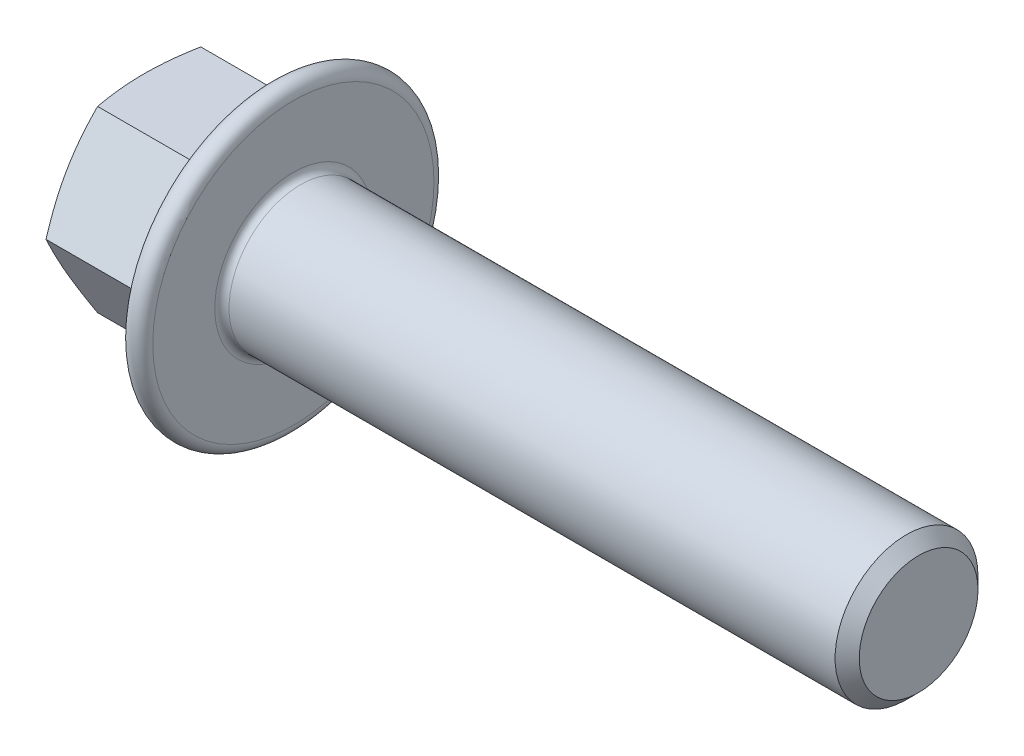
ISO-10303-21;
HEADER;
FILE_DESCRIPTION(('STEP AP214'),'2;1');
FILE_NAME('part.step','',(''),(''),'','','');
FILE_SCHEMA(('AUTOMOTIVE_DESIGN { 1 0 10303 214 1 1 1 1 }'));
ENDSEC;
DATA;
#1=APPLICATION_CONTEXT('core data for automotive mechanical design processes');
#2=APPLICATION_PROTOCOL_DEFINITION('international standard','automotive_design',2000,#1);
#3=PRODUCT_CONTEXT('',#1,'mechanical');
#4=PRODUCT('Part','Part','',(#3));
#5=PRODUCT_RELATED_PRODUCT_CATEGORY('part','',(#4));
#6=PRODUCT_DEFINITION_FORMATION('','',#4);
#7=PRODUCT_DEFINITION_CONTEXT('part definition',#1,'design');
#8=PRODUCT_DEFINITION('design','',#6,#7);
#9=PRODUCT_DEFINITION_SHAPE('','',#8);
#10=(LENGTH_UNIT() NAMED_UNIT(*) SI_UNIT(.MILLI.,.METRE.));
#11=(NAMED_UNIT(*) PLANE_ANGLE_UNIT() SI_UNIT($,.RADIAN.));
#12=(NAMED_UNIT(*) SI_UNIT($,.STERADIAN.) SOLID_ANGLE_UNIT());
#13=UNCERTAINTY_MEASURE_WITH_UNIT(LENGTH_MEASURE(1.E-05),#10,'distance_accuracy_value','');
#14=(GEOMETRIC_REPRESENTATION_CONTEXT(3) GLOBAL_UNCERTAINTY_ASSIGNED_CONTEXT((#13)) GLOBAL_UNIT_ASSIGNED_CONTEXT((#10,
#11,#12)) REPRESENTATION_CONTEXT('',''));
#15=CARTESIAN_POINT('',(0.,0.,0.));
#16=DIRECTION('',(0.,0.,1.));
#17=DIRECTION('',(1.,0.,0.));
#18=AXIS2_PLACEMENT_3D('',#15,#16,#17);
#19=CARTESIAN_POINT('',(8.5,-5.,-2.88675134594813));
#20=DIRECTION('',(1.,0.,0.));
#21=DIRECTION('',(0.,0.,-1.));
#22=AXIS2_PLACEMENT_3D('',#19,#20,#21);
#23=PLANE('',#22);
#24=CARTESIAN_POINT('',(8.5,0.,0.));
#25=DIRECTION('',(1.,0.,0.));
#26=DIRECTION('',(0.,0.,-1.));
#27=AXIS2_PLACEMENT_3D('',#24,#25,#26);
#28=CIRCLE('',#27,4.4);
#29=CARTESIAN_POINT('',(8.5,0.,-4.4));
#30=VERTEX_POINT('',#29);
#31=EDGE_CURVE('E443',#30,#30,#28,.F.);
#32=ORIENTED_EDGE('',*,*,#31,.T.);
#33=EDGE_LOOP('',(#32));
#34=FACE_BOUND('',#33,.T.);
#35=CARTESIAN_POINT('',(8.50000000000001,0.,0.));
#36=DIRECTION('',(-1.,0.,0.));
#37=DIRECTION('',(0.,0.,1.));
#38=AXIS2_PLACEMENT_3D('',#35,#36,#37);
#39=CIRCLE('',#38,7.87051088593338);
#40=CARTESIAN_POINT('',(8.50000000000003,0.,7.87051088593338));
#41=VERTEX_POINT('',#40);
#42=EDGE_CURVE('E338',#41,#41,#39,.T.);
#43=ORIENTED_EDGE('',*,*,#42,.F.);
#44=EDGE_LOOP('',(#43));
#45=FACE_BOUND('',#44,.T.);
#46=ADVANCED_FACE('F33',(#34,#45),#23,.T.);
#47=CARTESIAN_POINT('',(43.5,0.,0.));
#48=DIRECTION('',(-1.,0.,0.));
#49=DIRECTION('',(0.,0.,1.));
#50=AXIS2_PLACEMENT_3D('',#47,#48,#49);
#51=CYLINDRICAL_SURFACE('',#50,4.);
#52=CARTESIAN_POINT('',(42.8235,0.,0.));
#53=DIRECTION('',(1.,0.,0.));
#54=DIRECTION('',(0.,0.,-1.));
#55=AXIS2_PLACEMENT_3D('',#52,#53,#54);
#56=CIRCLE('',#55,4.);
#57=CARTESIAN_POINT('',(42.8235,0.,-4.));
#58=VERTEX_POINT('',#57);
#59=EDGE_CURVE('E11',#58,#58,#56,.F.);
#60=ORIENTED_EDGE('',*,*,#59,.T.);
#61=EDGE_LOOP('',(#60));
#62=FACE_BOUND('',#61,.T.);
#63=CARTESIAN_POINT('',(8.9,0.,0.));
#64=DIRECTION('',(1.,0.,0.));
#65=DIRECTION('',(0.,0.,-1.));
#66=AXIS2_PLACEMENT_3D('',#63,#64,#65);
#67=CIRCLE('',#66,4.);
#68=CARTESIAN_POINT('',(8.9,0.,-4.));
#69=VERTEX_POINT('',#68);
#70=EDGE_CURVE('E442',#69,#69,#67,.T.);
#71=ORIENTED_EDGE('',*,*,#70,.T.);
#72=EDGE_LOOP('',(#71));
#73=FACE_BOUND('',#72,.T.);
#74=ADVANCED_FACE('F321',(#62,#73),#51,.T.);
#75=CARTESIAN_POINT('',(43.5,0.,0.));
#76=DIRECTION('',(1.,0.,0.));
#77=DIRECTION('',(0.,0.,-1.));
#78=AXIS2_PLACEMENT_3D('',#75,#76,#77);
#79=PLANE('',#78);
#80=CARTESIAN_POINT('',(43.5,0.,0.));
#81=DIRECTION('',(1.,0.,0.));
#82=DIRECTION('',(0.,0.,-1.));
#83=AXIS2_PLACEMENT_3D('',#80,#81,#82);
#84=CIRCLE('',#83,3.3235);
#85=CARTESIAN_POINT('',(43.5,0.,-3.3235));
#86=VERTEX_POINT('',#85);
#87=EDGE_CURVE('E42',#86,#86,#84,.T.);
#88=ORIENTED_EDGE('',*,*,#87,.T.);
#89=EDGE_LOOP('',(#88));
#90=FACE_BOUND('',#89,.T.);
#91=ADVANCED_FACE('F153',(#90),#79,.T.);
#92=CARTESIAN_POINT('',(7.30000000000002,0.,0.));
#93=DIRECTION('',(1.,0.,0.));
#94=DIRECTION('',(0.,0.,-1.));
#95=AXIS2_PLACEMENT_3D('',#92,#93,#94);
#96=CONICAL_SURFACE('',#95,8.13654448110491,1.13446401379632);
#97=CARTESIAN_POINT('',(6.27466313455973,-6.41687112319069,2.06872042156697));
#98=CARTESIAN_POINT('',(6.61629893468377,-6.32924245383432,2.1193128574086));
#99=CARTESIAN_POINT('',(6.72781702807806,-6.46903238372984,2.42749444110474));
#100=CARTESIAN_POINT('',(6.21947581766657,-6.25545961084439,2.16191140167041));
#101=CARTESIAN_POINT('',(6.55983661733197,-6.17067616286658,2.21086114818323));
#102=CARTESIAN_POINT('',(6.6726297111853,-6.30912347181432,2.51668834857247));
#103=CARTESIAN_POINT('',(6.16613042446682,-6.0935733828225,2.25537645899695));
#104=CARTESIAN_POINT('',(6.50507475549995,-6.01144317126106,2.30279435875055));
#105=CARTESIAN_POINT('',(6.61928431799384,-6.14893699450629,2.60598469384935));
#106=CARTESIAN_POINT('',(6.06387858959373,-5.76869291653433,2.44294628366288));
#107=CARTESIAN_POINT('',(6.40003362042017,-5.69218456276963,2.48711840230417));
#108=CARTESIAN_POINT('',(6.51703248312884,-5.82795012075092,2.78490141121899));
#109=CARTESIAN_POINT('',(6.01497375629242,-5.60569829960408,2.53705126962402));
#110=CARTESIAN_POINT('',(6.34973801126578,-5.53216344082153,2.57950664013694));
#111=CARTESIAN_POINT('',(6.46812764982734,-5.66714952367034,2.87452188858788));
#112=CARTESIAN_POINT('',(5.87573980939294,-5.11367470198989,2.82112122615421));
#113=CARTESIAN_POINT('',(6.2067133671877,-5.05052441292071,2.85758106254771));
#114=CARTESIAN_POINT('',(6.32889370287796,-5.18261740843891,3.14467339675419));
#115=CARTESIAN_POINT('',(5.79334748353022,-4.78290179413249,3.01209305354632));
#116=CARTESIAN_POINT('',(6.1215719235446,-4.72655929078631,3.04462241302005));
#117=CARTESIAN_POINT('',(6.24650137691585,-4.8580409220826,3.32577895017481));
#118=CARTESIAN_POINT('',(5.65938222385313,-4.12583805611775,3.39144897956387));
#119=CARTESIAN_POINT('',(5.98318533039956,-4.08448009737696,3.415327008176));
#120=CARTESIAN_POINT('',(6.11253611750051,-4.21627289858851,3.68539782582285));
#121=CARTESIAN_POINT('',(5.60702749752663,-3.79967233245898,3.57976084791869));
#122=CARTESIAN_POINT('',(5.92882380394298,-3.76593250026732,3.59924054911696));
#123=CARTESIAN_POINT('',(6.06018139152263,-3.89912237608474,3.86384643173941));
#124=CARTESIAN_POINT('',(5.55413506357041,-3.30870938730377,3.86321843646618));
#125=CARTESIAN_POINT('',(5.87397934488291,-3.28722423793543,3.87562289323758));
#126=CARTESIAN_POINT('',(6.00728895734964,-3.4238003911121,4.13344234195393));
#127=CARTESIAN_POINT('',(5.54077806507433,-3.14492068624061,3.95778188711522));
#128=CARTESIAN_POINT('',(5.86012177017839,-3.12768051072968,3.96773550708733));
#129=CARTESIAN_POINT('',(5.99393195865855,-3.26557228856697,4.22354444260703));
#130=CARTESIAN_POINT('',(5.52304410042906,-2.81697121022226,4.14712360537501));
#131=CARTESIAN_POINT('',(5.84173890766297,-2.80848910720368,4.15202074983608));
#132=CARTESIAN_POINT('',(5.97619799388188,-2.94931073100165,4.40446837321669));
#133=CARTESIAN_POINT('',(5.51866696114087,-2.65281044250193,4.24190186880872));
#134=CARTESIAN_POINT('',(5.83719461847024,-2.64867956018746,4.24428683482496));
#135=CARTESIAN_POINT('',(5.97182085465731,-2.79127727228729,4.49529018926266));
#136=CARTESIAN_POINT('',(5.51908712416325,-2.32510816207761,4.43110086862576));
#137=CARTESIAN_POINT('',(5.83763024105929,-2.32983149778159,4.42837384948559));
#138=CARTESIAN_POINT('',(5.97224101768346,-2.47618113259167,4.6772509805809));
#139=CARTESIAN_POINT('',(5.52385038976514,-2.16156661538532,4.52552162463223));
#140=CARTESIAN_POINT('',(5.84257527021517,-2.17062322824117,4.52029278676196));
#141=CARTESIAN_POINT('',(5.97700428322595,-2.31911702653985,4.76838752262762));
#142=CARTESIAN_POINT('',(5.54227521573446,-1.83485253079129,4.71415008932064));
#143=CARTESIAN_POINT('',(5.86167394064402,-1.85262599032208,4.70388857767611));
#144=CARTESIAN_POINT('',(5.9954291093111,-2.00550112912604,4.95118705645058));
#145=CARTESIAN_POINT('',(5.55593776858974,-1.67168003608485,4.80835777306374));
#146=CARTESIAN_POINT('',(5.87584795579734,-1.69367768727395,4.79565742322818));
#147=CARTESIAN_POINT('',(6.00909166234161,-1.84894939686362,5.04285010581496));
#148=CARTESIAN_POINT('',(5.60961343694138,-1.18259456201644,5.09073140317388));
#149=CARTESIAN_POINT('',(5.9315028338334,-1.2167723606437,5.07099884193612));
#150=CARTESIAN_POINT('',(6.06276733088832,-1.37960709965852,5.31872003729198));
#151=CARTESIAN_POINT('',(5.66231091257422,-0.857699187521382,5.27830983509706));
#152=CARTESIAN_POINT('',(5.98621469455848,-0.899455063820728,5.25420206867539));
#153=CARTESIAN_POINT('',(6.11546480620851,-1.06769090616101,5.50348274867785));
#154=CARTESIAN_POINT('',(5.79664166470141,-0.203216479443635,5.65617560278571));
#155=CARTESIAN_POINT('',(6.12497248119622,-0.259861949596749,5.62347132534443));
#156=CARTESIAN_POINT('',(6.24979555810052,-0.43780567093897,5.87805885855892));
#157=CARTESIAN_POINT('',(5.87904510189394,0.126246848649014,5.84639134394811));
#158=CARTESIAN_POINT('',(6.21011795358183,0.0628331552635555,5.80977943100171));
#159=CARTESIAN_POINT('',(6.3321989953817,-0.119912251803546,6.06786856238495));
#160=CARTESIAN_POINT('',(6.01811753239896,0.616341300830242,6.12934750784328));
#161=CARTESIAN_POINT('',(6.35297107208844,0.542607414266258,6.08677722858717));
#162=CARTESIAN_POINT('',(6.47127142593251,0.354478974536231,6.35132020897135));
#163=CARTESIAN_POINT('',(6.06693941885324,0.778700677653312,6.22308573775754));
#164=CARTESIAN_POINT('',(6.40317915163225,0.702011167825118,6.17880902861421));
#165=CARTESIAN_POINT('',(6.5200933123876,0.511887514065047,6.44540589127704));
#166=CARTESIAN_POINT('',(6.16897764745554,1.10232132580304,6.40992820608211));
#167=CARTESIAN_POINT('',(6.5079969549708,1.02004299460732,6.36242478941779));
#168=CARTESIAN_POINT('',(6.6221315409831,0.826122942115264,6.63320962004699));
#169=CARTESIAN_POINT('',(6.22219242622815,1.26358296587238,6.5030326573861));
#170=CARTESIAN_POINT('',(6.56262268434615,1.17866628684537,6.45400598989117));
#171=CARTESIAN_POINT('',(6.6753463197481,0.98295001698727,6.72692778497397));
#172=CARTESIAN_POINT('',(6.27723060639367,1.42437414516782,6.59586548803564));
#173=CARTESIAN_POINT('',(6.61893137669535,1.33662876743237,6.54520567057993));
#174=CARTESIAN_POINT('',(6.730384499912,1.13955163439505,6.82045808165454));
#175=(BOUNDED_SURFACE() B_SPLINE_SURFACE(3,2,((#97,#98,#99),(#100,#101,#102),(#103,#104,#105),
(#106,#107,#108),(#109,#110,#111),(#112,#113,#114),(#115,#116,#117),(#118,#119,#120),(#121,#122,
#123),(#124,#125,#126),(#127,#128,#129),(#130,#131,#132),(#133,#134,#135),(#136,#137,#138),
(#139,#140,#141),(#142,#143,#144),(#145,#146,#147),(#148,#149,#150),(#151,#152,#153),(#154,#155,
#156),(#157,#158,#159),(#160,#161,#162),(#163,#164,#165),(#166,#167,#168),(#169,#170,#171),
(#172,#173,#174)),.UNSPECIFIED.,.F.,.F.,.F.) B_SPLINE_SURFACE_WITH_KNOTS((4,2,2,2,2,2,2,2,2,2,2,
2,4),(3,3),(0.,0.583128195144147,1.1664667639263,2.3378312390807,3.47713603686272,
4.04574405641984,4.6143411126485,5.18082495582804,5.7473719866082,6.88248672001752,
8.04944028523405,8.63058721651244,9.21152820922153),(0.,1.),
.UNSPECIFIED.) GEOMETRIC_REPRESENTATION_ITEM() RATIONAL_B_SPLINE_SURFACE(((1.,0.814378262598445,
1.),(1.,0.816042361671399,1.),(1.,0.817731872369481,1.),(1.,0.821116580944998,1.),(1.,
0.822811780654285,1.),(1.,0.827849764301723,1.),(1.,0.83113081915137,1.),(1.,0.836793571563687,
1.),(1.,0.83919742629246,1.),(1.,0.841685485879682,1.),(1.,0.842328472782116,1.),(1.,
0.843186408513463,1.),(1.,0.843401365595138,1.),(1.,0.843380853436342,1.),(1.,0.843147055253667,
1.),(1.,0.842256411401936,1.),(1.,0.841599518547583,1.),(1.,0.839078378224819,1.),(1.,
0.836664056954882,1.),(1.,0.830997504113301,1.),(1.,0.827723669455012,1.),(1.,0.822701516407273,
1.),(1.,0.821012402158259,1.),(1.,0.817640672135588,1.),(1.,0.815958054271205,1.),(1.,
0.814300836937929,1.))) REPRESENTATION_ITEM('') SURFACE());
#176=CARTESIAN_POINT('',(6.730384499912,1.13955163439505,6.82045808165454));
#177=CARTESIAN_POINT('',(6.6753463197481,0.98295001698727,6.72692778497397));
#178=CARTESIAN_POINT('',(6.6221315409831,0.826122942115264,6.63320962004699));
#179=CARTESIAN_POINT('',(6.5200933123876,0.511887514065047,6.44540589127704));
#180=CARTESIAN_POINT('',(6.47127142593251,0.354478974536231,6.35132020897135));
#181=CARTESIAN_POINT('',(6.3321989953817,-0.119912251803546,6.06786856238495));
#182=CARTESIAN_POINT('',(6.24979555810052,-0.43780567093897,5.87805885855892));
#183=CARTESIAN_POINT('',(6.11546480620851,-1.06769090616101,5.50348274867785));
#184=CARTESIAN_POINT('',(6.06276733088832,-1.37960709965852,5.31872003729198));
#185=CARTESIAN_POINT('',(6.00909166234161,-1.84894939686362,5.04285010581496));
#186=CARTESIAN_POINT('',(5.9954291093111,-2.00550112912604,4.95118705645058));
#187=CARTESIAN_POINT('',(5.97700428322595,-2.31911702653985,4.76838752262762));
#188=CARTESIAN_POINT('',(5.97224101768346,-2.47618113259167,4.6772509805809));
#189=CARTESIAN_POINT('',(5.97182085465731,-2.79127727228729,4.49529018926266));
#190=CARTESIAN_POINT('',(5.97619799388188,-2.94931073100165,4.40446837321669));
#191=CARTESIAN_POINT('',(5.99393195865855,-3.26557228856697,4.22354444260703));
#192=CARTESIAN_POINT('',(6.00728895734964,-3.4238003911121,4.13344234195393));
#193=CARTESIAN_POINT('',(6.06018139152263,-3.89912237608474,3.86384643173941));
#194=CARTESIAN_POINT('',(6.11253611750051,-4.21627289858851,3.68539782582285));
#195=CARTESIAN_POINT('',(6.24650137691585,-4.8580409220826,3.32577895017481));
#196=CARTESIAN_POINT('',(6.32889370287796,-5.18261740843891,3.1446733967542));
#197=CARTESIAN_POINT('',(6.46812764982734,-5.66714952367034,2.87452188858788));
#198=CARTESIAN_POINT('',(6.51703248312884,-5.82795012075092,2.78490141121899));
#199=CARTESIAN_POINT('',(6.61928431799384,-6.14893699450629,2.60598469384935));
#200=CARTESIAN_POINT('',(6.6726297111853,-6.30912347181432,2.51668834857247));
#201=CARTESIAN_POINT('',(6.72781702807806,-6.46903238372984,2.42749444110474));
#202=B_SPLINE_CURVE_WITH_KNOTS('',3,(#176,#177,#178,#179,#180,#181,#182,#183,#184,#185,#186,
#187,#188,#189,#190,#191,#192,#193,#194,#195,#196,#197,#198,#199,#200,#201),.UNSPECIFIED.,.F.,
.F.,(4,2,2,2,2,2,2,2,2,2,2,2,4),(0.,0.580940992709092,1.16208792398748,2.32904148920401,
3.46415622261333,4.03070325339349,4.59718709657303,5.16578415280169,5.73439217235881,
6.87369697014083,8.04506144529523,8.62840001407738,9.21152820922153),.UNSPECIFIED.);
#203=CARTESIAN_POINT('',(6.36878330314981,0.,6.13954383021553));
#204=VERTEX_POINT('',#203);
#205=CARTESIAN_POINT('',(6.3687833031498,-5.31700092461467,3.06977191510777));
#206=VERTEX_POINT('',#205);
#207=EDGE_CURVE('E456',#204,#206,#202,.T.);
#208=ORIENTED_EDGE('',*,*,#207,.T.);
#209=CARTESIAN_POINT('',(6.26792755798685,-5.,-4.50003723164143));
#210=CARTESIAN_POINT('',(6.60939255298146,-5.,-4.39920770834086));
#211=CARTESIAN_POINT('',(6.72108145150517,-5.33645629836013,-4.36622764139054));
#212=CARTESIAN_POINT('',(6.21334597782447,-5.,-4.31514483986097));
#213=CARTESIAN_POINT('',(6.55354482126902,-5.,-4.21758426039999));
#214=CARTESIAN_POINT('',(6.66649987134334,-5.33376484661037,-4.18462865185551));
#215=CARTESIAN_POINT('',(6.16058959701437,-5.,-4.1297109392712));
#216=CARTESIAN_POINT('',(6.49938387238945,-5.,-4.03520111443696));
#217=CARTESIAN_POINT('',(6.61374349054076,-5.33102512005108,-4.0027420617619));
#218=CARTESIAN_POINT('',(6.05946752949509,-5.,-3.75758245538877));
#219=CARTESIAN_POINT('',(6.39549683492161,-5.,-3.66953381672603));
#220=CARTESIAN_POINT('',(6.51262142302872,-5.32552207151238,-3.63828650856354));
#221=CARTESIAN_POINT('',(6.01110340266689,-5.,-3.5708874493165));
#222=CARTESIAN_POINT('',(6.34575451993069,-5.,-3.48625411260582));
#223=CARTESIAN_POINT('',(6.46425729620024,-5.32275874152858,-3.45571732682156));
#224=CARTESIAN_POINT('',(5.87340626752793,-5.,-3.00736442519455));
#225=CARTESIAN_POINT('',(6.20429959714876,-5.,-2.93464081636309));
#226=CARTESIAN_POINT('',(6.32656016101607,-5.31452422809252,-2.90557669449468));
#227=CARTESIAN_POINT('',(5.79191094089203,-5.,-2.62855422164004));
#228=CARTESIAN_POINT('',(6.1200845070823,-5.,-2.56363948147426));
#229=CARTESIAN_POINT('',(6.24506483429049,-5.30913090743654,-2.53700312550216));
#230=CARTESIAN_POINT('',(5.65925186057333,-5.,-1.87600965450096));
#231=CARTESIAN_POINT('',(5.98304519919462,-5.,-1.82826898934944));
#232=CARTESIAN_POINT('',(6.11240575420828,-5.29977267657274,-1.80740431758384));
#233=CARTESIAN_POINT('',(5.60732631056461,-5.,-1.50241573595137));
#234=CARTESIAN_POINT('',(5.92913237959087,-5.,-1.4634079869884));
#235=CARTESIAN_POINT('',(6.06048020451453,-5.29577303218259,-1.44644504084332));
#236=CARTESIAN_POINT('',(5.55464743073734,-5.,-0.940056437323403));
#237=CARTESIAN_POINT('',(5.87451009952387,-5.,-0.915081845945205));
#238=CARTESIAN_POINT('',(6.00780132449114,-5.29160726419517,-0.904387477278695));
#239=CARTESIAN_POINT('',(5.54129007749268,-5.,-0.752440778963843));
#240=CARTESIAN_POINT('',(5.86065255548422,-5.,-0.732328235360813));
#241=CARTESIAN_POINT('',(5.99444397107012,-5.29052443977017,-0.723757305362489));
#242=CARTESIAN_POINT('',(5.52340783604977,-5.,-0.376797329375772));
#243=CARTESIAN_POINT('',(5.84211610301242,-5.,-0.366713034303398));
#244=CARTESIAN_POINT('',(5.97656172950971,-5.28906676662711,-0.362322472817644));
#245=CARTESIAN_POINT('',(5.51888197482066,-5.,-0.18876958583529));
#246=CARTESIAN_POINT('',(5.83741753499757,-5.,-0.183669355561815));
#247=CARTESIAN_POINT('',(5.97203586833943,-5.28869183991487,-0.181517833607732));
#248=CARTESIAN_POINT('',(5.51885835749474,-5.,0.187766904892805));
#249=CARTESIAN_POINT('',(5.83739305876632,-5.,0.182693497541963));
#250=CARTESIAN_POINT('',(5.97201225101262,-5.28868989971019,0.180553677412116));
#251=CARTESIAN_POINT('',(5.52338369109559,-5.,0.376275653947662));
#252=CARTESIAN_POINT('',(5.84209110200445,-5.,0.366205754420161));
#253=CARTESIAN_POINT('',(5.97653758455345,-5.28906479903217,0.361820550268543));
#254=CARTESIAN_POINT('',(5.54130942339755,-5.,0.752861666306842));
#255=CARTESIAN_POINT('',(5.86067262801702,-5.,0.732738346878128));
#256=CARTESIAN_POINT('',(5.99446331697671,-5.29052601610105,0.724162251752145));
#257=CARTESIAN_POINT('',(5.55470998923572,-5.,0.940938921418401));
#258=CARTESIAN_POINT('',(5.87457507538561,-5.,0.915942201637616));
#259=CARTESIAN_POINT('',(6.00786388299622,-5.29161234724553,0.90523707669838));
#260=CARTESIAN_POINT('',(5.60758043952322,-5.,1.50469820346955));
#261=CARTESIAN_POINT('',(5.9293960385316,-5.,1.4656365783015));
#262=CARTESIAN_POINT('',(6.06073433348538,-5.29579285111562,1.44864709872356));
#263=CARTESIAN_POINT('',(5.65971625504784,-5.,1.87922343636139));
#264=CARTESIAN_POINT('',(5.98352755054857,-5.,1.83141146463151));
#265=CARTESIAN_POINT('',(6.1128701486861,-5.29980792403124,1.81051132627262));
#266=CARTESIAN_POINT('',(5.79291700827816,-5.,2.63365523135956));
#267=CARTESIAN_POINT('',(6.12112475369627,-5.,2.56863651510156));
#268=CARTESIAN_POINT('',(6.2460709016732,-5.30919938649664,2.5419578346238));
#269=CARTESIAN_POINT('',(5.8747489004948,-5.,3.01342015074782));
#270=CARTESIAN_POINT('',(6.2056863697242,-5.,2.94057961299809));
#271=CARTESIAN_POINT('',(6.32790279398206,-5.31461064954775,2.91147357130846));
#272=CARTESIAN_POINT('',(6.01299712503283,-5.,3.57835090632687));
#273=CARTESIAN_POINT('',(6.34770327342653,-5.,3.49358082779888));
#274=CARTESIAN_POINT('',(6.46615101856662,-5.32286877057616,3.46301133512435));
#275=CARTESIAN_POINT('',(6.06155159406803,-5.,3.76550810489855));
#276=CARTESIAN_POINT('',(6.39763999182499,-5.,3.67731884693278));
#277=CARTESIAN_POINT('',(6.51470548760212,-5.32563937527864,3.64604057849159));
#278=CARTESIAN_POINT('',(6.16306563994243,-5.,4.13855570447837));
#279=CARTESIAN_POINT('',(6.50192673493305,-5.,4.04389930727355));
#280=CARTESIAN_POINT('',(6.61621953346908,-5.33115577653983,4.0114129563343));
#281=CARTESIAN_POINT('',(6.21602364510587,-5.,4.32444653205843));
#282=CARTESIAN_POINT('',(6.55629298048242,-5.,4.22673697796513));
#283=CARTESIAN_POINT('',(6.6691775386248,-5.33390158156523,4.19375631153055));
#284=CARTESIAN_POINT('',(6.27081047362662,-5.,4.50979406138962));
#285=CARTESIAN_POINT('',(6.61234863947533,-5.,4.40881212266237));
#286=CARTESIAN_POINT('',(6.72396436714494,-5.33659845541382,4.37581091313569));
#287=(BOUNDED_SURFACE() B_SPLINE_SURFACE(3,2,((#209,#210,#211),(#212,#213,#214),(#215,#216,
#217),(#218,#219,#220),(#221,#222,#223),(#224,#225,#226),(#227,#228,#229),(#230,#231,#232),
(#233,#234,#235),(#236,#237,#238),(#239,#240,#241),(#242,#243,#244),(#245,#246,#247),(#248,#249,
#250),(#251,#252,#253),(#254,#255,#256),(#257,#258,#259),(#260,#261,#262),(#263,#264,#265),
(#266,#267,#268),(#269,#270,#271),(#272,#273,#274),(#275,#276,#277),(#278,#279,#280),(#281,#282,
#283),(#284,#285,#286)),.UNSPECIFIED.,.F.,.F.,.F.) B_SPLINE_SURFACE_WITH_KNOTS((4,2,2,2,2,2,2,2,
2,2,2,2,4),(3,3),(0.,0.578327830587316,1.1568602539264,2.31848444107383,3.44864377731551,
4.01273422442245,4.57676251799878,5.1422314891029,5.70771110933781,6.84071529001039,
8.00534836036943,8.58536620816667,9.16517792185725),(0.,1.),
.UNSPECIFIED.) GEOMETRIC_REPRESENTATION_ITEM() RATIONAL_B_SPLINE_SURFACE(((1.,0.814581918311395,
1.),(1.,0.816234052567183,1.),(1.,0.817910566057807,1.),(1.,0.821267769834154,1.),(1.,
0.822948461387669,1.),(1.,0.827941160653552,1.),(1.,0.83119005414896,1.),(1.,0.836800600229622,
1.),(1.,0.839183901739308,1.),(1.,0.841661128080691,1.),(1.,0.842303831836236,1.),(1.,
0.843168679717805,1.),(1.,0.843390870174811,1.),(1.,0.84339202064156,1.),(1.,0.843169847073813,
1.),(1.,0.842302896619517,1.),(1.,0.841658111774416,1.),(1.,0.839172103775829,1.),(1.,
0.836779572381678,1.),(1.,0.831148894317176,1.),(1.,0.827889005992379,1.),(1.,0.822881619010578,
1.),(1.,0.82119635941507,1.),(1.,0.817830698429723,1.),(1.,0.816150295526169,1.),(1.,
0.814494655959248,1.))) REPRESENTATION_ITEM('') SURFACE());
#288=CARTESIAN_POINT('',(6.72396436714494,-5.33659845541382,4.37581091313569));
#289=CARTESIAN_POINT('',(6.6691775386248,-5.33390158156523,4.19375631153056));
#290=CARTESIAN_POINT('',(6.61621953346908,-5.33115577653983,4.0114129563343));
#291=CARTESIAN_POINT('',(6.51470548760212,-5.32563937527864,3.64604057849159));
#292=CARTESIAN_POINT('',(6.46615101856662,-5.32286877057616,3.46301133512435));
#293=CARTESIAN_POINT('',(6.32790279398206,-5.31461064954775,2.91147357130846));
#294=CARTESIAN_POINT('',(6.2460709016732,-5.30919938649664,2.5419578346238));
#295=CARTESIAN_POINT('',(6.1128701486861,-5.29980792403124,1.81051132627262));
#296=CARTESIAN_POINT('',(6.06073433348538,-5.29579285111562,1.44864709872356));
#297=CARTESIAN_POINT('',(6.00786388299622,-5.29161234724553,0.90523707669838));
#298=CARTESIAN_POINT('',(5.99446331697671,-5.29052601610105,0.724162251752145));
#299=CARTESIAN_POINT('',(5.97653758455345,-5.28906479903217,0.361820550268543));
#300=CARTESIAN_POINT('',(5.97201225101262,-5.28868989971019,0.180553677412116));
#301=CARTESIAN_POINT('',(5.97203586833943,-5.28869183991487,-0.181517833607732));
#302=CARTESIAN_POINT('',(5.97656172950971,-5.28906676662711,-0.362322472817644));
#303=CARTESIAN_POINT('',(5.99444397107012,-5.29052443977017,-0.723757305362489));
#304=CARTESIAN_POINT('',(6.00780132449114,-5.29160726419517,-0.904387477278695));
#305=CARTESIAN_POINT('',(6.06048020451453,-5.29577303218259,-1.44644504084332));
#306=CARTESIAN_POINT('',(6.11240575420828,-5.29977267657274,-1.80740431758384));
#307=CARTESIAN_POINT('',(6.24506483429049,-5.30913090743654,-2.53700312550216));
#308=CARTESIAN_POINT('',(6.32656016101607,-5.31452422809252,-2.90557669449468));
#309=CARTESIAN_POINT('',(6.46425729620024,-5.32275874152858,-3.45571732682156));
#310=CARTESIAN_POINT('',(6.51262142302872,-5.32552207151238,-3.63828650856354));
#311=CARTESIAN_POINT('',(6.61374349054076,-5.33102512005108,-4.0027420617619));
#312=CARTESIAN_POINT('',(6.66649987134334,-5.33376484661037,-4.18462865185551));
#313=CARTESIAN_POINT('',(6.72108145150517,-5.33645629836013,-4.36622764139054));
#314=B_SPLINE_CURVE_WITH_KNOTS('',3,(#288,#289,#290,#291,#292,#293,#294,#295,#296,#297,#298,
#299,#300,#301,#302,#303,#304,#305,#306,#307,#308,#309,#310,#311,#312,#313),.UNSPECIFIED.,.F.,
.F.,(4,2,2,2,2,2,2,2,2,2,2,2,4),(0.,0.579811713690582,1.15982956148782,2.32446263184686,
3.45746681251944,4.02294643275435,4.58841540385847,5.1524436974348,5.71653414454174,
6.84669348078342,8.00831766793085,8.58685009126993,9.16517792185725),.UNSPECIFIED.);
#315=CARTESIAN_POINT('',(6.36878330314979,-5.31700092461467,-3.06977191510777));
#316=VERTEX_POINT('',#315);
#317=EDGE_CURVE('E385',#206,#316,#314,.T.);
#318=ORIENTED_EDGE('',*,*,#317,.T.);
#319=CARTESIAN_POINT('',(6.27466313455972,1.4168711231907,-6.59153361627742));
#320=CARTESIAN_POINT('',(6.61629893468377,1.32924245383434,-6.54094118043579));
#321=CARTESIAN_POINT('',(6.72781702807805,1.13224433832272,-6.81609360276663));
#322=CARTESIAN_POINT('',(6.21947581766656,1.25545961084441,-6.49834263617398));
#323=CARTESIAN_POINT('',(6.55983661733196,1.17067616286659,-6.44939288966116));
#324=CARTESIAN_POINT('',(6.67262971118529,0.975045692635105,-6.72220537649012));
#325=CARTESIAN_POINT('',(6.16613042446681,1.09357338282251,-6.40487757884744));
#326=CARTESIAN_POINT('',(6.50507475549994,1.01144317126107,-6.35745967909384));
#327=CARTESIAN_POINT('',(6.61928431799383,0.81761955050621,-6.62812799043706));
#328=CARTESIAN_POINT('',(6.06387858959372,0.768692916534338,-6.21730775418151));
#329=CARTESIAN_POINT('',(6.40003362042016,0.692184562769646,-6.17313563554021));
#330=CARTESIAN_POINT('',(6.51703248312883,0.502179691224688,-6.43960356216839));
#331=CARTESIAN_POINT('',(6.01497375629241,0.605698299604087,-6.12320276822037));
#332=CARTESIAN_POINT('',(6.34973801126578,0.532163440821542,-6.08074739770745));
#333=CARTESIAN_POINT('',(6.46812764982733,0.344165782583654,-6.34515639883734));
#334=CARTESIAN_POINT('',(5.87573980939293,0.113674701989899,-5.83913281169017));
#335=CARTESIAN_POINT('',(6.20671336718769,0.0505244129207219,-5.80267297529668));
#336=CARTESIAN_POINT('',(6.32889370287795,-0.132058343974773,-6.06061503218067));
#337=CARTESIAN_POINT('',(5.79334748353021,-0.217098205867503,-5.64816098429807));
#338=CARTESIAN_POINT('',(6.12157192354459,-0.273440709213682,-5.61563162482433));
#339=CARTESIAN_POINT('',(6.24650137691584,-0.451188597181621,-5.87007632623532));
#340=CARTESIAN_POINT('',(5.65938222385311,-0.874161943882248,-5.26880505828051));
#341=CARTESIAN_POINT('',(5.98318533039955,-0.915519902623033,-5.24492702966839));
#342=CARTESIAN_POINT('',(6.1125361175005,-1.08351169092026,-5.49409835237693));
#343=CARTESIAN_POINT('',(5.60702749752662,-1.20032766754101,-5.0804931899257));
#344=CARTESIAN_POINT('',(5.92882380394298,-1.23406749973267,-5.06101348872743));
#345=CARTESIAN_POINT('',(6.06018139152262,-1.39662797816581,-5.30866224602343));
#346=CARTESIAN_POINT('',(5.5541350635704,-1.69129061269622,-4.79703560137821));
#347=CARTESIAN_POINT('',(5.8739793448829,-1.71277576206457,-4.78463114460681));
#348=CARTESIAN_POINT('',(6.00728895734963,-1.86776587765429,-5.03181928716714));
#349=CARTESIAN_POINT('',(5.54077806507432,-1.85507931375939,-4.70247215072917));
#350=CARTESIAN_POINT('',(5.86012177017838,-1.87231948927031,-4.69251853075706));
#351=CARTESIAN_POINT('',(5.99393195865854,-2.02491063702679,-4.939840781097));
#352=CARTESIAN_POINT('',(5.52304410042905,-2.18302878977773,-4.51313043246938));
#353=CARTESIAN_POINT('',(5.84173890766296,-2.19151089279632,-4.5082332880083));
#354=CARTESIAN_POINT('',(5.97619799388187,-2.33972613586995,-4.75641220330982));
#355=CARTESIAN_POINT('',(5.51866696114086,-2.34718955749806,-4.41835216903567));
#356=CARTESIAN_POINT('',(5.83719461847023,-2.35132043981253,-4.41596720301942));
#357=CARTESIAN_POINT('',(5.9718208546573,-2.49739686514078,-4.66496212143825));
#358=CARTESIAN_POINT('',(5.51908712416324,-2.67489183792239,-4.22915316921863));
#359=CARTESIAN_POINT('',(5.83763024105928,-2.67016850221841,-4.2318801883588));
#360=CARTESIAN_POINT('',(5.97224101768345,-2.8125276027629,-4.48306125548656));
#361=CARTESIAN_POINT('',(5.52385038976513,-2.83843338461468,-4.13473241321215));
#362=CARTESIAN_POINT('',(5.84257527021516,-2.82937677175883,-4.13996125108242));
#363=CARTESIAN_POINT('',(5.97700428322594,-2.96998621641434,-4.39260802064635));
#364=CARTESIAN_POINT('',(5.54227521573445,-3.16514746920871,-3.94610394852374));
#365=CARTESIAN_POINT('',(5.86167394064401,-3.14737400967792,-3.95636546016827));
#366=CARTESIAN_POINT('',(5.99542910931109,-3.28510320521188,-4.21240845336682));
#367=CARTESIAN_POINT('',(5.55593776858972,-3.32831996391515,-3.85189626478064));
#368=CARTESIAN_POINT('',(5.87584795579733,-3.30632231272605,-3.8645966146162));
#369=CARTESIAN_POINT('',(6.0090916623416,-3.442761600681,-4.12266220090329));
#370=CARTESIAN_POINT('',(5.60961343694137,-3.81740543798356,-3.56952263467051));
#371=CARTESIAN_POINT('',(5.93150283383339,-3.78322763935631,-3.58925519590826));
#372=CARTESIAN_POINT('',(6.06276733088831,-3.91634311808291,-3.85413481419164));
#373=CARTESIAN_POINT('',(5.66231091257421,-4.14230081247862,-3.38194420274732));
#374=CARTESIAN_POINT('',(5.98621469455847,-4.10054493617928,-3.40605196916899));
#375=CARTESIAN_POINT('',(6.1154648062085,-4.23231041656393,-3.67638882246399));
#376=CARTESIAN_POINT('',(5.7966416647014,-4.79678352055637,-3.00407843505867));
#377=CARTESIAN_POINT('',(6.12497248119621,-4.74013805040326,-3.03678271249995));
#378=CARTESIAN_POINT('',(6.24979555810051,-4.87164546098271,-3.3181802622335));
#379=CARTESIAN_POINT('',(5.87904510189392,-5.12624684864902,-2.81386269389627));
#380=CARTESIAN_POINT('',(6.21011795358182,-5.06283315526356,-2.85047460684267));
#381=CARTESIAN_POINT('',(6.33219899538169,-5.19497219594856,-3.13778133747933));
#382=CARTESIAN_POINT('',(6.01811753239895,-5.61634130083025,-2.5309065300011));
#383=CARTESIAN_POINT('',(6.35297107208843,-5.54260741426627,-2.57347680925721));
#384=CARTESIAN_POINT('',(6.4712714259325,-5.6776441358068,-2.86867230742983));
#385=CARTESIAN_POINT('',(6.06693941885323,-5.77870067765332,-2.43716830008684));
#386=CARTESIAN_POINT('',(6.40317915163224,-5.70201116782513,-2.48144500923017));
#387=CARTESIAN_POINT('',(6.52009331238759,-5.83782899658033,-2.77939535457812));
#388=CARTESIAN_POINT('',(6.16897764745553,-6.10232132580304,-2.25032583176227));
#389=CARTESIAN_POINT('',(6.50799695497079,-6.02004299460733,-2.29782924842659));
#390=CARTESIAN_POINT('',(6.62213154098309,-6.15758951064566,-2.60116135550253));
#391=CARTESIAN_POINT('',(6.22219242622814,-6.26358296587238,-2.15722138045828));
#392=CARTESIAN_POINT('',(6.56262268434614,-6.17866628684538,-2.20624804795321));
#393=CARTESIAN_POINT('',(6.67534631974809,-6.31716535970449,-2.51220420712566));
#394=CARTESIAN_POINT('',(6.27723060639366,-6.42437414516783,-2.06438854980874));
#395=CARTESIAN_POINT('',(6.61893137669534,-6.33662876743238,-2.11504836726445));
#396=CARTESIAN_POINT('',(6.73038449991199,-6.47646578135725,-2.42334837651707));
#397=(BOUNDED_SURFACE() B_SPLINE_SURFACE(3,2,((#319,#320,#321),(#322,#323,#324),(#325,#326,
#327),(#328,#329,#330),(#331,#332,#333),(#334,#335,#336),(#337,#338,#339),(#340,#341,#342),
(#343,#344,#345),(#346,#347,#348),(#349,#350,#351),(#352,#353,#354),(#355,#356,#357),(#358,#359,
#360),(#361,#362,#363),(#364,#365,#366),(#367,#368,#369),(#370,#371,#372),(#373,#374,#375),
(#376,#377,#378),(#379,#380,#381),(#382,#383,#384),(#385,#386,#387),(#388,#389,#390),(#391,#392,
#393),(#394,#395,#396)),.UNSPECIFIED.,.F.,.F.,.F.) B_SPLINE_SURFACE_WITH_KNOTS((4,2,2,2,2,2,2,2,
2,2,2,2,4),(3,3),(0.,0.583128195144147,1.16646676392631,2.33783123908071,3.47713603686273,
4.04574405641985,4.61434111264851,5.18082495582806,5.74737198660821,6.88248672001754,
8.04944028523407,8.63058721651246,9.21152820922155),(0.,1.),
.UNSPECIFIED.) GEOMETRIC_REPRESENTATION_ITEM() RATIONAL_B_SPLINE_SURFACE(((1.,0.814378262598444,
1.),(1.,0.816042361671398,1.),(1.,0.81773187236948,1.),(1.,0.821116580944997,1.),(1.,
0.822811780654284,1.),(1.,0.827849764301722,1.),(1.,0.831130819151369,1.),(1.,0.836793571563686,
1.),(1.,0.839197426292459,1.),(1.,0.841685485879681,1.),(1.,0.842328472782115,1.),(1.,
0.843186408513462,1.),(1.,0.843401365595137,1.),(1.,0.843380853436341,1.),(1.,0.843147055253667,
1.),(1.,0.842256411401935,1.),(1.,0.841599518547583,1.),(1.,0.839078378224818,1.),(1.,
0.836664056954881,1.),(1.,0.8309975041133,1.),(1.,0.827723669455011,1.),(1.,0.822701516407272,
1.),(1.,0.821012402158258,1.),(1.,0.817640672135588,1.),(1.,0.815958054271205,1.),(1.,
0.814300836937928,1.))) REPRESENTATION_ITEM('') SURFACE());
#398=CARTESIAN_POINT('',(6.73038449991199,-6.47646578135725,-2.42334837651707));
#399=CARTESIAN_POINT('',(6.67534631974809,-6.31716535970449,-2.51220420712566));
#400=CARTESIAN_POINT('',(6.62213154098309,-6.15758951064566,-2.60116135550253));
#401=CARTESIAN_POINT('',(6.52009331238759,-5.83782899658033,-2.77939535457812));
#402=CARTESIAN_POINT('',(6.47127142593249,-5.6776441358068,-2.86867230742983));
#403=CARTESIAN_POINT('',(6.33219899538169,-5.19497219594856,-3.13778133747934));
#404=CARTESIAN_POINT('',(6.24979555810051,-4.87164546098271,-3.3181802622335));
#405=CARTESIAN_POINT('',(6.1154648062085,-4.23231041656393,-3.67638882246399));
#406=CARTESIAN_POINT('',(6.06276733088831,-3.91634311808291,-3.85413481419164));
#407=CARTESIAN_POINT('',(6.0090916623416,-3.442761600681,-4.12266220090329));
#408=CARTESIAN_POINT('',(5.99542910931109,-3.28510320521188,-4.21240845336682));
#409=CARTESIAN_POINT('',(5.97700428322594,-2.96998621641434,-4.39260802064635));
#410=CARTESIAN_POINT('',(5.97224101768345,-2.8125276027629,-4.48306125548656));
#411=CARTESIAN_POINT('',(5.9718208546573,-2.49739686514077,-4.66496212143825));
#412=CARTESIAN_POINT('',(5.97619799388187,-2.33972613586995,-4.75641220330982));
#413=CARTESIAN_POINT('',(5.99393195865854,-2.02491063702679,-4.939840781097));
#414=CARTESIAN_POINT('',(6.00728895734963,-1.86776587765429,-5.03181928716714));
#415=CARTESIAN_POINT('',(6.06018139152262,-1.39662797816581,-5.30866224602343));
#416=CARTESIAN_POINT('',(6.1125361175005,-1.08351169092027,-5.49409835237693));
#417=CARTESIAN_POINT('',(6.24650137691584,-0.45118859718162,-5.87007632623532));
#418=CARTESIAN_POINT('',(6.32889370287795,-0.132058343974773,-6.06061503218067));
#419=CARTESIAN_POINT('',(6.46812764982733,0.344165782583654,-6.34515639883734));
#420=CARTESIAN_POINT('',(6.51703248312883,0.502179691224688,-6.43960356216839));
#421=CARTESIAN_POINT('',(6.61928431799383,0.81761955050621,-6.62812799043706));
#422=CARTESIAN_POINT('',(6.67262971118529,0.975045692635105,-6.72220537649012));
#423=CARTESIAN_POINT('',(6.72781702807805,1.13224433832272,-6.81609360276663));
#424=B_SPLINE_CURVE_WITH_KNOTS('',3,(#398,#399,#400,#401,#402,#403,#404,#405,#406,#407,#408,
#409,#410,#411,#412,#413,#414,#415,#416,#417,#418,#419,#420,#421,#422,#423),.UNSPECIFIED.,.F.,
.F.,(4,2,2,2,2,2,2,2,2,2,2,2,4),(0.,0.580940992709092,1.16208792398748,2.32904148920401,
3.46415622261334,4.0307032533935,4.59718709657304,5.16578415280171,5.73439217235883,
6.87369697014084,8.04506144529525,8.62840001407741,9.21152820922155),.UNSPECIFIED.);
#425=CARTESIAN_POINT('',(6.36878330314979,0.,-6.13954383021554));
#426=VERTEX_POINT('',#425);
#427=EDGE_CURVE('E393',#316,#426,#424,.T.);
#428=ORIENTED_EDGE('',*,*,#427,.T.);
#429=CARTESIAN_POINT('',(6.27466313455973,6.41687112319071,-2.06872042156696));
#430=CARTESIAN_POINT('',(6.61629893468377,6.32924245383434,-2.11931285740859));
#431=CARTESIAN_POINT('',(6.72781702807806,6.46903238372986,-2.42749444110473));
#432=CARTESIAN_POINT('',(6.21947581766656,6.25545961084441,-2.1619114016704));
#433=CARTESIAN_POINT('',(6.55983661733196,6.1706761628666,-2.21086114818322));
#434=CARTESIAN_POINT('',(6.67262971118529,6.30912347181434,-2.51668834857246));
#435=CARTESIAN_POINT('',(6.16613042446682,6.09357338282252,-2.25537645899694));
#436=CARTESIAN_POINT('',(6.50507475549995,6.01144317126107,-2.30279435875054));
#437=CARTESIAN_POINT('',(6.61928431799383,6.14893699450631,-2.60598469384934));
#438=CARTESIAN_POINT('',(6.06387858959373,5.76869291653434,-2.44294628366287));
#439=CARTESIAN_POINT('',(6.40003362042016,5.69218456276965,-2.48711840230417));
#440=CARTESIAN_POINT('',(6.51703248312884,5.82795012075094,-2.78490141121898));
#441=CARTESIAN_POINT('',(6.01497375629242,5.60569829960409,-2.53705126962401));
#442=CARTESIAN_POINT('',(6.34973801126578,5.53216344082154,-2.57950664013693));
#443=CARTESIAN_POINT('',(6.46812764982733,5.66714952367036,-2.87452188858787));
#444=CARTESIAN_POINT('',(5.87573980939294,5.1136747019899,-2.82112122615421));
#445=CARTESIAN_POINT('',(6.20671336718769,5.05052441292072,-2.8575810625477));
#446=CARTESIAN_POINT('',(6.32889370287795,5.18261740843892,-3.14467339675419));
#447=CARTESIAN_POINT('',(5.79334748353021,4.7829017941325,-3.01209305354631));
#448=CARTESIAN_POINT('',(6.1215719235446,4.72655929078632,-3.04462241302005));
#449=CARTESIAN_POINT('',(6.24650137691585,4.85804092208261,-3.32577895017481));
#450=CARTESIAN_POINT('',(5.65938222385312,4.12583805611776,-3.39144897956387));
#451=CARTESIAN_POINT('',(5.98318533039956,4.08448009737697,-3.41532700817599));
#452=CARTESIAN_POINT('',(6.11253611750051,4.21627289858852,-3.68539782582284));
#453=CARTESIAN_POINT('',(5.60702749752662,3.79967233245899,-3.57976084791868));
#454=CARTESIAN_POINT('',(5.92882380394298,3.76593250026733,-3.59924054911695));
#455=CARTESIAN_POINT('',(6.06018139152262,3.89912237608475,-3.86384643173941));
#456=CARTESIAN_POINT('',(5.5541350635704,3.30870938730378,-3.86321843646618));
#457=CARTESIAN_POINT('',(5.8739793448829,3.28722423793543,-3.87562289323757));
#458=CARTESIAN_POINT('',(6.00728895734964,3.42380039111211,-4.13344234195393));
#459=CARTESIAN_POINT('',(5.54077806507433,3.14492068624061,-3.95778188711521));
#460=CARTESIAN_POINT('',(5.86012177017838,3.12768051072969,-3.96773550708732));
#461=CARTESIAN_POINT('',(5.99393195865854,3.26557228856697,-4.22354444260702));
#462=CARTESIAN_POINT('',(5.52304410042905,2.81697121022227,-4.147123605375));
#463=CARTESIAN_POINT('',(5.84173890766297,2.80848910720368,-4.15202074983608));
#464=CARTESIAN_POINT('',(5.97619799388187,2.94931073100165,-4.40446837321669));
#465=CARTESIAN_POINT('',(5.51866696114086,2.65281044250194,-4.24190186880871));
#466=CARTESIAN_POINT('',(5.83719461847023,2.64867956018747,-4.24428683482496));
#467=CARTESIAN_POINT('',(5.9718208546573,2.79127727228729,-4.49529018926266));
#468=CARTESIAN_POINT('',(5.51908712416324,2.32510816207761,-4.43110086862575));
#469=CARTESIAN_POINT('',(5.83763024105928,2.32983149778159,-4.42837384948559));
#470=CARTESIAN_POINT('',(5.97224101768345,2.47618113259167,-4.6772509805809));
#471=CARTESIAN_POINT('',(5.52385038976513,2.16156661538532,-4.52552162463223));
#472=CARTESIAN_POINT('',(5.84257527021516,2.17062322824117,-4.52029278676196));
#473=CARTESIAN_POINT('',(5.97700428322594,2.31911702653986,-4.76838752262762));
#474=CARTESIAN_POINT('',(5.54227521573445,1.83485253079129,-4.71415008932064));
#475=CARTESIAN_POINT('',(5.86167394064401,1.85262599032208,-4.70388857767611));
#476=CARTESIAN_POINT('',(5.99542910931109,2.00550112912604,-4.95118705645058));
#477=CARTESIAN_POINT('',(5.55593776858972,1.67168003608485,-4.80835777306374));
#478=CARTESIAN_POINT('',(5.87584795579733,1.69367768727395,-4.79565742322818));
#479=CARTESIAN_POINT('',(6.0090916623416,1.84894939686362,-5.04285010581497));
#480=CARTESIAN_POINT('',(5.60961343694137,1.18259456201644,-5.09073140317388));
#481=CARTESIAN_POINT('',(5.93150283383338,1.2167723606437,-5.07099884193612));
#482=CARTESIAN_POINT('',(6.06276733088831,1.37960709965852,-5.31872003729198));
#483=CARTESIAN_POINT('',(5.66231091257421,0.857699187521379,-5.27830983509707));
#484=CARTESIAN_POINT('',(5.98621469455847,0.899455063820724,-5.25420206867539));
#485=CARTESIAN_POINT('',(6.1154648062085,1.06769090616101,-5.50348274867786));
#486=CARTESIAN_POINT('',(5.7966416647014,0.203216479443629,-5.65617560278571));
#487=CARTESIAN_POINT('',(6.12497248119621,0.259861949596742,-5.62347132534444));
#488=CARTESIAN_POINT('',(6.24979555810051,0.437805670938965,-5.87805885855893));
#489=CARTESIAN_POINT('',(5.87904510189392,-0.126246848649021,-5.84639134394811));
#490=CARTESIAN_POINT('',(6.21011795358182,-0.0628331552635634,-5.80977943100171));
#491=CARTESIAN_POINT('',(6.33219899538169,0.119912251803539,-6.06786856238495));
#492=CARTESIAN_POINT('',(6.01811753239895,-0.616341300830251,-6.12934750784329));
#493=CARTESIAN_POINT('',(6.35297107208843,-0.542607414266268,-6.08677722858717));
#494=CARTESIAN_POINT('',(6.47127142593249,-0.35447897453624,-6.35132020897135));
#495=CARTESIAN_POINT('',(6.06693941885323,-0.778700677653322,-6.22308573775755));
#496=CARTESIAN_POINT('',(6.40317915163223,-0.702011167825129,-6.17880902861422));
#497=CARTESIAN_POINT('',(6.52009331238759,-0.511887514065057,-6.44540589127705));
#498=CARTESIAN_POINT('',(6.16897764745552,-1.10232132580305,-6.40992820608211));
#499=CARTESIAN_POINT('',(6.50799695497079,-1.02004299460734,-6.3624247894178));
#500=CARTESIAN_POINT('',(6.62213154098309,-0.826122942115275,-6.633209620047));
#501=CARTESIAN_POINT('',(6.22219242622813,-1.26358296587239,-6.50303265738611));
#502=CARTESIAN_POINT('',(6.56262268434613,-1.17866628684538,-6.45400598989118));
#503=CARTESIAN_POINT('',(6.67534631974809,-0.982950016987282,-6.72692778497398));
#504=CARTESIAN_POINT('',(6.27723060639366,-1.42437414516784,-6.59586548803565));
#505=CARTESIAN_POINT('',(6.61893137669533,-1.33662876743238,-6.54520567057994));
#506=CARTESIAN_POINT('',(6.73038449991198,-1.13955163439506,-6.82045808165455));
#507=(BOUNDED_SURFACE() B_SPLINE_SURFACE(3,2,((#429,#430,#431),(#432,#433,#434),(#435,#436,
#437),(#438,#439,#440),(#441,#442,#443),(#444,#445,#446),(#447,#448,#449),(#450,#451,#452),
(#453,#454,#455),(#456,#457,#458),(#459,#460,#461),(#462,#463,#464),(#465,#466,#467),(#468,#469,
#470),(#471,#472,#473),(#474,#475,#476),(#477,#478,#479),(#480,#481,#482),(#483,#484,#485),
(#486,#487,#488),(#489,#490,#491),(#492,#493,#494),(#495,#496,#497),(#498,#499,#500),(#501,#502,
#503),(#504,#505,#506)),.UNSPECIFIED.,.F.,.F.,.F.) B_SPLINE_SURFACE_WITH_KNOTS((4,2,2,2,2,2,2,2,
2,2,2,2,4),(3,3),(0.,0.583128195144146,1.16646676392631,2.33783123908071,3.47713603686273,
4.04574405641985,4.61434111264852,5.18082495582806,5.74737198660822,6.88248672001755,
8.04944028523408,8.63058721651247,9.21152820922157),(0.,1.),
.UNSPECIFIED.) GEOMETRIC_REPRESENTATION_ITEM() RATIONAL_B_SPLINE_SURFACE(((1.,0.814378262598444,
1.),(1.,0.816042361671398,1.),(1.,0.81773187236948,1.),(1.,0.821116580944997,1.),(1.,
0.822811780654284,1.),(1.,0.827849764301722,1.),(1.,0.831130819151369,1.),(1.,0.836793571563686,
1.),(1.,0.839197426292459,1.),(1.,0.841685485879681,1.),(1.,0.842328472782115,1.),(1.,
0.843186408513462,1.),(1.,0.843401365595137,1.),(1.,0.843380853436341,1.),(1.,0.843147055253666,
1.),(1.,0.842256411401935,1.),(1.,0.841599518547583,1.),(1.,0.839078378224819,1.),(1.,
0.836664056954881,1.),(1.,0.8309975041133,1.),(1.,0.827723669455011,1.),(1.,0.822701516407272,
1.),(1.,0.821012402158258,1.),(1.,0.817640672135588,1.),(1.,0.815958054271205,1.),(1.,
0.814300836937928,1.))) REPRESENTATION_ITEM('') SURFACE());
#508=CARTESIAN_POINT('',(6.73038449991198,-1.13955163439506,-6.82045808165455));
#509=CARTESIAN_POINT('',(6.67534631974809,-0.982950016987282,-6.72692778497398));
#510=CARTESIAN_POINT('',(6.62213154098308,-0.826122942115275,-6.633209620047));
#511=CARTESIAN_POINT('',(6.52009331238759,-0.511887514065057,-6.44540589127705));
#512=CARTESIAN_POINT('',(6.47127142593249,-0.354478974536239,-6.35132020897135));
#513=CARTESIAN_POINT('',(6.33219899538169,0.119912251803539,-6.06786856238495));
#514=CARTESIAN_POINT('',(6.24979555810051,0.437805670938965,-5.87805885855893));
#515=CARTESIAN_POINT('',(6.1154648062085,1.06769090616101,-5.50348274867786));
#516=CARTESIAN_POINT('',(6.0627673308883,1.37960709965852,-5.31872003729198));
#517=CARTESIAN_POINT('',(6.0090916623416,1.84894939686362,-5.04285010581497));
#518=CARTESIAN_POINT('',(5.99542910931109,2.00550112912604,-4.95118705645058));
#519=CARTESIAN_POINT('',(5.97700428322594,2.31911702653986,-4.76838752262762));
#520=CARTESIAN_POINT('',(5.97224101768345,2.47618113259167,-4.6772509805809));
#521=CARTESIAN_POINT('',(5.9718208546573,2.79127727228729,-4.49529018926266));
#522=CARTESIAN_POINT('',(5.97619799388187,2.94931073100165,-4.40446837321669));
#523=CARTESIAN_POINT('',(5.99393195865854,3.26557228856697,-4.22354444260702));
#524=CARTESIAN_POINT('',(6.00728895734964,3.42380039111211,-4.13344234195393));
#525=CARTESIAN_POINT('',(6.06018139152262,3.89912237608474,-3.86384643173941));
#526=CARTESIAN_POINT('',(6.11253611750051,4.21627289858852,-3.68539782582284));
#527=CARTESIAN_POINT('',(6.24650137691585,4.85804092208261,-3.32577895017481));
#528=CARTESIAN_POINT('',(6.32889370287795,5.18261740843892,-3.14467339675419));
#529=CARTESIAN_POINT('',(6.46812764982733,5.66714952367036,-2.87452188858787));
#530=CARTESIAN_POINT('',(6.51703248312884,5.82795012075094,-2.78490141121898));
#531=CARTESIAN_POINT('',(6.61928431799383,6.14893699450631,-2.60598469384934));
#532=CARTESIAN_POINT('',(6.67262971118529,6.30912347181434,-2.51668834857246));
#533=CARTESIAN_POINT('',(6.72781702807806,6.46903238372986,-2.42749444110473));
#534=B_SPLINE_CURVE_WITH_KNOTS('',3,(#508,#509,#510,#511,#512,#513,#514,#515,#516,#517,#518,
#519,#520,#521,#522,#523,#524,#525,#526,#527,#528,#529,#530,#531,#532,#533),.UNSPECIFIED.,.F.,
.F.,(4,2,2,2,2,2,2,2,2,2,2,2,4),(0.,0.580940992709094,1.16208792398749,2.32904148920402,
3.46415622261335,4.03070325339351,4.59718709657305,5.16578415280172,5.73439217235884,
6.87369697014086,8.04506144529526,8.62840001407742,9.21152820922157),.UNSPECIFIED.);
#535=CARTESIAN_POINT('',(6.36878330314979,5.31700092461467,-3.06977191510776));
#536=VERTEX_POINT('',#535);
#537=EDGE_CURVE('E471',#426,#536,#534,.T.);
#538=ORIENTED_EDGE('',*,*,#537,.T.);
#539=CARTESIAN_POINT('',(6.26865254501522,5.,4.50249204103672));
#540=CARTESIAN_POINT('',(6.61013594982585,5.,4.40162414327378));
#541=CARTESIAN_POINT('',(6.72180643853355,5.33649207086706,4.36863874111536));
#542=CARTESIAN_POINT('',(6.21400586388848,5.,4.31743946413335));
#543=CARTESIAN_POINT('',(6.55422216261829,5.,4.2198422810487));
#544=CARTESIAN_POINT('',(6.66715975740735,5.3337985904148,4.18688026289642));
#545=CARTESIAN_POINT('',(6.16118618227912,5.,4.13184466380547));
#546=CARTESIAN_POINT('',(6.49999663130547,5.,4.03729963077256));
#547=CARTESIAN_POINT('',(6.61434007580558,5.33105664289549,4.00483375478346));
#548=CARTESIAN_POINT('',(6.05994269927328,5.,3.75939237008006));
#549=CARTESIAN_POINT('',(6.39598555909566,5.,3.67131179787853));
#550=CARTESIAN_POINT('',(6.51309659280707,5.32554885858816,3.64005715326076));
#551=CARTESIAN_POINT('',(6.01152046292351,5.,3.57253445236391));
#552=CARTESIAN_POINT('',(6.34618377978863,5.,3.48787114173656));
#553=CARTESIAN_POINT('',(6.46467435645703,5.32278301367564,3.45732684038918));
#554=CARTESIAN_POINT('',(5.87365816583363,5.,3.00851499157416));
#555=CARTESIAN_POINT('',(6.20456015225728,5.,2.93577015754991));
#556=CARTESIAN_POINT('',(6.32681205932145,5.31454059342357,2.90669673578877));
#557=CARTESIAN_POINT('',(5.7920664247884,5.,2.6293678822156));
#558=CARTESIAN_POINT('',(6.12024549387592,5.,2.56443751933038));
#559=CARTESIAN_POINT('',(6.24522031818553,5.30914158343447,2.53779301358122));
#560=CARTESIAN_POINT('',(5.65926676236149,5.,1.87616016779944));
#561=CARTESIAN_POINT('',(5.98306117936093,5.,1.82841770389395));
#562=CARTESIAN_POINT('',(6.11242065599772,5.29977402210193,1.80754924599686));
#563=CARTESIAN_POINT('',(5.60729491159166,5.,1.50224043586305));
#564=CARTESIAN_POINT('',(5.92909995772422,5.,1.46323774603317));
#565=CARTESIAN_POINT('',(6.06044880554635,5.29577065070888,1.44627536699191));
#566=CARTESIAN_POINT('',(5.55459255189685,5.,0.939390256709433));
#567=CARTESIAN_POINT('',(5.87445325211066,5.,0.914433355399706));
#568=CARTESIAN_POINT('',(6.0077464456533,5.29160287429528,0.903745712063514));
#569=CARTESIAN_POINT('',(5.54123501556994,5.,0.75161112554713));
#570=CARTESIAN_POINT('',(5.86059547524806,5.,0.731520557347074));
#571=CARTESIAN_POINT('',(5.99438890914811,5.2905199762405,0.722958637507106));
#572=CARTESIAN_POINT('',(5.52336839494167,5.,0.375640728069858));
#573=CARTESIAN_POINT('',(5.8420752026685,5.,0.365587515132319));
#574=CARTESIAN_POINT('',(5.97652228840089,5.28906352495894,0.361210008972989));
#575=CARTESIAN_POINT('',(5.51885833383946,5.,0.187449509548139));
#576=CARTESIAN_POINT('',(5.83739302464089,5.,0.182384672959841));
#577=CARTESIAN_POINT('',(5.972012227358,5.28868989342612,0.180248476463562));
#578=CARTESIAN_POINT('',(5.51888205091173,5.,-0.189286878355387));
#579=CARTESIAN_POINT('',(5.83741762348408,5.,-0.184172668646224));
#580=CARTESIAN_POINT('',(5.97203594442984,5.28869185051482,-0.182015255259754));
#581=CARTESIAN_POINT('',(5.52343287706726,5.,-0.377832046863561));
#582=CARTESIAN_POINT('',(5.84214212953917,5.,-0.367720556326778));
#583=CARTESIAN_POINT('',(5.97658677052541,5.28906885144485,-0.363317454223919));
#584=CARTESIAN_POINT('',(5.54141207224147,5.,-0.754489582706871));
#585=CARTESIAN_POINT('',(5.86077905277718,5.,-0.734323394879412));
#586=CARTESIAN_POINT('',(5.99456596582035,5.29053434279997,-0.725729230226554));
#587=CARTESIAN_POINT('',(5.55484060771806,5.,-0.942601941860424));
#588=CARTESIAN_POINT('',(5.87471049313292,5.,-0.917561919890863));
#589=CARTESIAN_POINT('',(6.00799450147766,5.29162284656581,-0.906838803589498));
#590=CARTESIAN_POINT('',(5.6077970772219,5.,-1.50646560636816));
#591=CARTESIAN_POINT('',(5.92962054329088,5.,-1.46736075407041));
#592=CARTESIAN_POINT('',(6.06095097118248,5.29580963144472,-1.4503531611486));
#593=CARTESIAN_POINT('',(5.65999295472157,5.,-1.88105816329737));
#594=CARTESIAN_POINT('',(5.98381411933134,5.,-1.83320295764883));
#595=CARTESIAN_POINT('',(6.11314684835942,5.2998285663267,-1.81228608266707));
#596=CARTESIAN_POINT('',(5.79331453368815,5.,-2.6356284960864));
#597=CARTESIAN_POINT('',(6.12153542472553,5.,-2.57056801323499));
#598=CARTESIAN_POINT('',(6.24646842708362,5.30922628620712,-2.54387523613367));
#599=CARTESIAN_POINT('',(5.87520753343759,5.,-3.01546446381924));
#600=CARTESIAN_POINT('',(6.20615946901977,5.,-2.94258286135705));
#601=CARTESIAN_POINT('',(6.32836142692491,5.31463991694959,-2.91346483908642));
#602=CARTESIAN_POINT('',(6.01354386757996,5.,-3.58049983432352));
#603=CARTESIAN_POINT('',(6.34826577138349,5.,-3.49569006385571));
#604=CARTESIAN_POINT('',(6.46669776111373,5.32290046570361,-3.46511164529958));
#605=CARTESIAN_POINT('',(6.06212692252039,5.,-3.76769105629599));
#606=CARTESIAN_POINT('',(6.39823149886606,5.,-3.6794627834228));
#607=CARTESIAN_POINT('',(6.51528081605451,5.32567168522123,-3.64817642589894));
#608=CARTESIAN_POINT('',(6.16369699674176,5.,-4.14080657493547));
#609=CARTESIAN_POINT('',(6.50257500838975,5.,-4.04611263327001));
#610=CARTESIAN_POINT('',(6.61685089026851,5.33118902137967,-4.01361972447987));
#611=CARTESIAN_POINT('',(6.21668244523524,5.,-4.32673129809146));
#612=CARTESIAN_POINT('',(6.55696898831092,5.,-4.22898491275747));
#613=CARTESIAN_POINT('',(6.66983633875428,5.33393514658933,-4.19599846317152));
#614=CARTESIAN_POINT('',(6.27149613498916,5.,-4.51211272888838));
#615=CARTESIAN_POINT('',(6.61305168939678,5.,-4.41109461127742));
#616=CARTESIAN_POINT('',(6.72465002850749,5.33663222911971,-4.37808840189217));
#617=(BOUNDED_SURFACE() B_SPLINE_SURFACE(3,2,((#539,#540,#541),(#542,#543,#544),(#545,#546,
#547),(#548,#549,#550),(#551,#552,#553),(#554,#555,#556),(#557,#558,#559),(#560,#561,#562),
(#563,#564,#565),(#566,#567,#568),(#569,#570,#571),(#572,#573,#574),(#575,#576,#577),(#578,#579,
#580),(#581,#582,#583),(#584,#585,#586),(#587,#588,#589),(#590,#591,#592),(#593,#594,#595),
(#596,#597,#598),(#599,#600,#601),(#602,#603,#604),(#605,#606,#607),(#608,#609,#610),(#611,#612,
#613),(#614,#615,#616)),.UNSPECIFIED.,.F.,.F.,.F.) B_SPLINE_SURFACE_WITH_KNOTS((4,2,2,2,2,2,2,2,
2,2,2,2,4),(3,3),(0.,0.578844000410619,1.1578932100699,2.32056463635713,3.45170752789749,
4.01628668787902,4.58080351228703,5.14638347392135,5.71197404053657,6.84520317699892,
8.01008364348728,8.59022185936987,9.17015396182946),(0.,1.),
.UNSPECIFIED.) GEOMETRIC_REPRESENTATION_ITEM() RATIONAL_B_SPLINE_SURFACE(((1.,0.814559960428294,
1.),(1.,0.816213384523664,1.),(1.,0.817891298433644,1.),(1.,0.821251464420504,1.),(1.,
0.822933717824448,1.),(1.,0.827931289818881,1.),(1.,0.83118364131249,1.),(1.,0.836799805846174,
1.),(1.,0.839185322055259,1.),(1.,0.841663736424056,1.),(1.,0.842306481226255,1.),(1.,
0.843170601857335,1.),(1.,0.843392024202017,1.),(1.,0.843390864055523,1.),(1.,0.843167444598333,
1.),(1.,0.842297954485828,1.),(1.,0.841651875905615,1.),(1.,0.839162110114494,1.),(1.,
0.836767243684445,1.),(1.,0.831132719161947,1.),(1.,0.827871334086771,1.),(1.,0.822862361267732,
1.),(1.,0.821176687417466,1.),(1.,0.817810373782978,1.),(1.,0.816129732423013,1.),(1.,
0.814473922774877,1.))) REPRESENTATION_ITEM('') SURFACE());
#618=CARTESIAN_POINT('',(6.72465002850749,5.33663222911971,-4.37808840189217));
#619=CARTESIAN_POINT('',(6.66983633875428,5.33393514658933,-4.19599846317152));
#620=CARTESIAN_POINT('',(6.61685089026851,5.33118902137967,-4.01361972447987));
#621=CARTESIAN_POINT('',(6.51528081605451,5.32567168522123,-3.64817642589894));
#622=CARTESIAN_POINT('',(6.46669776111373,5.32290046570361,-3.46511164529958));
#623=CARTESIAN_POINT('',(6.32836142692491,5.31463991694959,-2.91346483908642));
#624=CARTESIAN_POINT('',(6.24646842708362,5.30922628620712,-2.54387523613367));
#625=CARTESIAN_POINT('',(6.11314684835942,5.2998285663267,-1.81228608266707));
#626=CARTESIAN_POINT('',(6.06095097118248,5.29580963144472,-1.4503531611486));
#627=CARTESIAN_POINT('',(6.00799450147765,5.29162284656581,-0.906838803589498));
#628=CARTESIAN_POINT('',(5.99456596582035,5.29053434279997,-0.725729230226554));
#629=CARTESIAN_POINT('',(5.97658677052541,5.28906885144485,-0.363317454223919));
#630=CARTESIAN_POINT('',(5.97203594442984,5.28869185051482,-0.182015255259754));
#631=CARTESIAN_POINT('',(5.972012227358,5.28868989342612,0.180248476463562));
#632=CARTESIAN_POINT('',(5.97652228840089,5.28906352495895,0.361210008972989));
#633=CARTESIAN_POINT('',(5.99438890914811,5.2905199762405,0.722958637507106));
#634=CARTESIAN_POINT('',(6.0077464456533,5.29160287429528,0.903745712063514));
#635=CARTESIAN_POINT('',(6.06044880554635,5.29577065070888,1.44627536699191));
#636=CARTESIAN_POINT('',(6.11242065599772,5.29977402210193,1.80754924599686));
#637=CARTESIAN_POINT('',(6.24522031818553,5.30914158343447,2.53779301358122));
#638=CARTESIAN_POINT('',(6.32681205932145,5.31454059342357,2.90669673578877));
#639=CARTESIAN_POINT('',(6.46467435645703,5.32278301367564,3.45732684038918));
#640=CARTESIAN_POINT('',(6.51309659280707,5.32554885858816,3.64005715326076));
#641=CARTESIAN_POINT('',(6.61434007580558,5.33105664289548,4.00483375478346));
#642=CARTESIAN_POINT('',(6.66715975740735,5.3337985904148,4.18688026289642));
#643=CARTESIAN_POINT('',(6.72180643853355,5.33649207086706,4.36863874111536));
#644=B_SPLINE_CURVE_WITH_KNOTS('',3,(#618,#619,#620,#621,#622,#623,#624,#625,#626,#627,#628,
#629,#630,#631,#632,#633,#634,#635,#636,#637,#638,#639,#640,#641,#642,#643),.UNSPECIFIED.,.F.,
.F.,(4,2,2,2,2,2,2,2,2,2,2,2,4),(0.,0.579932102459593,1.16007031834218,2.32495078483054,
3.45817992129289,4.02377048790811,4.58935044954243,5.15386727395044,5.71844643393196,
6.84958932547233,8.01226075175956,8.59130996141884,9.17015396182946),.UNSPECIFIED.);
#645=CARTESIAN_POINT('',(6.3687833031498,5.31700092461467,3.06977191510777));
#646=VERTEX_POINT('',#645);
#647=EDGE_CURVE('E467',#536,#646,#644,.T.);
#648=ORIENTED_EDGE('',*,*,#647,.T.);
#649=CARTESIAN_POINT('',(6.27466313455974,-1.41687112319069,6.59153361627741));
#650=CARTESIAN_POINT('',(6.61629893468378,-1.32924245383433,6.54094118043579));
#651=CARTESIAN_POINT('',(6.72781702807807,-1.13224433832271,6.81609360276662));
#652=CARTESIAN_POINT('',(6.21947581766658,-1.2554596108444,6.49834263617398));
#653=CARTESIAN_POINT('',(6.55983661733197,-1.17067616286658,6.44939288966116));
#654=CARTESIAN_POINT('',(6.67262971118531,-0.975045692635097,6.72220537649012));
#655=CARTESIAN_POINT('',(6.16613042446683,-1.0935733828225,6.40487757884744));
#656=CARTESIAN_POINT('',(6.50507475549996,-1.01144317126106,6.35745967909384));
#657=CARTESIAN_POINT('',(6.61928431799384,-0.817619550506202,6.62812799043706));
#658=CARTESIAN_POINT('',(6.06387858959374,-0.76869291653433,6.21730775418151));
#659=CARTESIAN_POINT('',(6.40003362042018,-0.692184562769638,6.17313563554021));
#660=CARTESIAN_POINT('',(6.51703248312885,-0.502179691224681,6.43960356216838));
#661=CARTESIAN_POINT('',(6.01497375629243,-0.60569829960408,6.12320276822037));
#662=CARTESIAN_POINT('',(6.34973801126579,-0.532163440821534,6.08074739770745));
#663=CARTESIAN_POINT('',(6.46812764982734,-0.344165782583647,6.34515639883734));
#664=CARTESIAN_POINT('',(5.87573980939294,-0.113674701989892,5.83913281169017));
#665=CARTESIAN_POINT('',(6.2067133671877,-0.0505244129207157,5.80267297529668));
#666=CARTESIAN_POINT('',(6.32889370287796,0.132058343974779,6.06061503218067));
#667=CARTESIAN_POINT('',(5.79334748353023,0.217098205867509,5.64816098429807));
#668=CARTESIAN_POINT('',(6.12157192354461,0.273440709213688,5.61563162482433));
#669=CARTESIAN_POINT('',(6.24650137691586,0.451188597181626,5.87007632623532));
#670=CARTESIAN_POINT('',(5.65938222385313,0.874161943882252,5.26880505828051));
#671=CARTESIAN_POINT('',(5.98318533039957,0.915519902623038,5.24492702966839));
#672=CARTESIAN_POINT('',(6.11253611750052,1.08351169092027,5.49409835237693));
#673=CARTESIAN_POINT('',(5.60702749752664,1.20032766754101,5.0804931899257));
#674=CARTESIAN_POINT('',(5.92882380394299,1.23406749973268,5.06101348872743));
#675=CARTESIAN_POINT('',(6.06018139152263,1.39662797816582,5.30866224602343));
#676=CARTESIAN_POINT('',(5.55413506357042,1.69129061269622,4.79703560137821));
#677=CARTESIAN_POINT('',(5.87397934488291,1.71277576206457,4.78463114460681));
#678=CARTESIAN_POINT('',(6.00728895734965,1.8677658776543,5.03181928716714));
#679=CARTESIAN_POINT('',(5.54077806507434,1.85507931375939,4.70247215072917));
#680=CARTESIAN_POINT('',(5.86012177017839,1.87231948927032,4.69251853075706));
#681=CARTESIAN_POINT('',(5.99393195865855,2.02491063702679,4.939840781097));
#682=CARTESIAN_POINT('',(5.52304410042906,2.18302878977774,4.51313043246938));
#683=CARTESIAN_POINT('',(5.84173890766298,2.19151089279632,4.5082332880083));
#684=CARTESIAN_POINT('',(5.97619799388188,2.33972613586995,4.75641220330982));
#685=CARTESIAN_POINT('',(5.51866696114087,2.34718955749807,4.41835216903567));
#686=CARTESIAN_POINT('',(5.83719461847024,2.35132043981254,4.41596720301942));
#687=CARTESIAN_POINT('',(5.97182085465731,2.49739686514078,4.66496212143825));
#688=CARTESIAN_POINT('',(5.51908712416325,2.67489183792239,4.22915316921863));
#689=CARTESIAN_POINT('',(5.83763024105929,2.67016850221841,4.2318801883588));
#690=CARTESIAN_POINT('',(5.97224101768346,2.8125276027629,4.48306125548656));
#691=CARTESIAN_POINT('',(5.52385038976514,2.83843338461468,4.13473241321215));
#692=CARTESIAN_POINT('',(5.84257527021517,2.82937677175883,4.13996125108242));
#693=CARTESIAN_POINT('',(5.97700428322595,2.96998621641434,4.39260802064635));
#694=CARTESIAN_POINT('',(5.54227521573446,3.16514746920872,3.94610394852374));
#695=CARTESIAN_POINT('',(5.86167394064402,3.14737400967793,3.95636546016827));
#696=CARTESIAN_POINT('',(5.9954291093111,3.28510320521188,4.21240845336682));
#697=CARTESIAN_POINT('',(5.55593776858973,3.32831996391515,3.85189626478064));
#698=CARTESIAN_POINT('',(5.87584795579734,3.30632231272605,3.8645966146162));
#699=CARTESIAN_POINT('',(6.00909166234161,3.442761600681,4.12266220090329));
#700=CARTESIAN_POINT('',(5.60961343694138,3.81740543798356,3.56952263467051));
#701=CARTESIAN_POINT('',(5.93150283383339,3.78322763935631,3.58925519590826));
#702=CARTESIAN_POINT('',(6.06276733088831,3.91634311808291,3.85413481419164));
#703=CARTESIAN_POINT('',(5.66231091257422,4.14230081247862,3.38194420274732));
#704=CARTESIAN_POINT('',(5.98621469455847,4.10054493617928,3.406051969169));
#705=CARTESIAN_POINT('',(6.11546480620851,4.23231041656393,3.67638882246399));
#706=CARTESIAN_POINT('',(5.79664166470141,4.79678352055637,3.00407843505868));
#707=CARTESIAN_POINT('',(6.12497248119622,4.74013805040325,3.03678271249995));
#708=CARTESIAN_POINT('',(6.24979555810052,4.87164546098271,3.3181802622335));
#709=CARTESIAN_POINT('',(5.87904510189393,5.12624684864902,2.81386269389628));
#710=CARTESIAN_POINT('',(6.21011795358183,5.06283315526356,2.85047460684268));
#711=CARTESIAN_POINT('',(6.3321989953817,5.19497219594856,3.13778133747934));
#712=CARTESIAN_POINT('',(6.01811753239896,5.61634130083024,2.5309065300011));
#713=CARTESIAN_POINT('',(6.35297107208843,5.54260741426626,2.57347680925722));
#714=CARTESIAN_POINT('',(6.4712714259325,5.67764413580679,2.86867230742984));
#715=CARTESIAN_POINT('',(6.06693941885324,5.77870067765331,2.43716830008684));
#716=CARTESIAN_POINT('',(6.40317915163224,5.70201116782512,2.48144500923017));
#717=CARTESIAN_POINT('',(6.5200933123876,5.83782899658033,2.77939535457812));
#718=CARTESIAN_POINT('',(6.16897764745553,6.10232132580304,2.25032583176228));
#719=CARTESIAN_POINT('',(6.5079969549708,6.02004299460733,2.2978292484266));
#720=CARTESIAN_POINT('',(6.6221315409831,6.15758951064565,2.60116135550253));
#721=CARTESIAN_POINT('',(6.22219242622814,6.26358296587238,2.15722138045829));
#722=CARTESIAN_POINT('',(6.56262268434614,6.17866628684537,2.20624804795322));
#723=CARTESIAN_POINT('',(6.67534631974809,6.31716535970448,2.51220420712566));
#724=CARTESIAN_POINT('',(6.27723060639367,6.42437414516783,2.06438854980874));
#725=CARTESIAN_POINT('',(6.61893137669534,6.33662876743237,2.11504836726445));
#726=CARTESIAN_POINT('',(6.73038449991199,6.47646578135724,2.42334837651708));
#727=(BOUNDED_SURFACE() B_SPLINE_SURFACE(3,2,((#649,#650,#651),(#652,#653,#654),(#655,#656,
#657),(#658,#659,#660),(#661,#662,#663),(#664,#665,#666),(#667,#668,#669),(#670,#671,#672),
(#673,#674,#675),(#676,#677,#678),(#679,#680,#681),(#682,#683,#684),(#685,#686,#687),(#688,#689,
#690),(#691,#692,#693),(#694,#695,#696),(#697,#698,#699),(#700,#701,#702),(#703,#704,#705),
(#706,#707,#708),(#709,#710,#711),(#712,#713,#714),(#715,#716,#717),(#718,#719,#720),(#721,#722,
#723),(#724,#725,#726)),.UNSPECIFIED.,.F.,.F.,.F.) B_SPLINE_SURFACE_WITH_KNOTS((4,2,2,2,2,2,2,2,
2,2,2,2,4),(3,3),(0.,0.583128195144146,1.1664667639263,2.33783123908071,3.47713603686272,
4.04574405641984,4.61434111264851,5.18082495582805,5.74737198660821,6.88248672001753,
8.04944028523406,8.63058721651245,9.21152820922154),(0.,1.),
.UNSPECIFIED.) GEOMETRIC_REPRESENTATION_ITEM() RATIONAL_B_SPLINE_SURFACE(((1.,0.814378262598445,
1.),(1.,0.816042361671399,1.),(1.,0.817731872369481,1.),(1.,0.821116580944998,1.),(1.,
0.822811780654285,1.),(1.,0.827849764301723,1.),(1.,0.83113081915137,1.),(1.,0.836793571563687,
1.),(1.,0.83919742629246,1.),(1.,0.841685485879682,1.),(1.,0.842328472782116,1.),(1.,
0.843186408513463,1.),(1.,0.843401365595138,1.),(1.,0.843380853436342,1.),(1.,0.843147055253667,
1.),(1.,0.842256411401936,1.),(1.,0.841599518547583,1.),(1.,0.839078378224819,1.),(1.,
0.836664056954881,1.),(1.,0.830997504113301,1.),(1.,0.827723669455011,1.),(1.,0.822701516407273,
1.),(1.,0.821012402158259,1.),(1.,0.817640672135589,1.),(1.,0.815958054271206,1.),(1.,
0.814300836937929,1.))) REPRESENTATION_ITEM('') SURFACE());
#728=CARTESIAN_POINT('',(6.73038449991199,6.47646578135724,2.42334837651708));
#729=CARTESIAN_POINT('',(6.6753463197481,6.31716535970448,2.51220420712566));
#730=CARTESIAN_POINT('',(6.6221315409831,6.15758951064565,2.60116135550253));
#731=CARTESIAN_POINT('',(6.5200933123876,5.83782899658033,2.77939535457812));
#732=CARTESIAN_POINT('',(6.4712714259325,5.67764413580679,2.86867230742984));
#733=CARTESIAN_POINT('',(6.3321989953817,5.19497219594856,3.13778133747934));
#734=CARTESIAN_POINT('',(6.24979555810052,4.87164546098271,3.3181802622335));
#735=CARTESIAN_POINT('',(6.11546480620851,4.23231041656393,3.67638882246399));
#736=CARTESIAN_POINT('',(6.06276733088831,3.91634311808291,3.85413481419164));
#737=CARTESIAN_POINT('',(6.00909166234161,3.442761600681,4.12266220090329));
#738=CARTESIAN_POINT('',(5.9954291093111,3.28510320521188,4.21240845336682));
#739=CARTESIAN_POINT('',(5.97700428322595,2.96998621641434,4.39260802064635));
#740=CARTESIAN_POINT('',(5.97224101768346,2.8125276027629,4.48306125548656));
#741=CARTESIAN_POINT('',(5.97182085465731,2.49739686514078,4.66496212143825));
#742=CARTESIAN_POINT('',(5.97619799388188,2.33972613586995,4.75641220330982));
#743=CARTESIAN_POINT('',(5.99393195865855,2.02491063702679,4.939840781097));
#744=CARTESIAN_POINT('',(6.00728895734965,1.8677658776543,5.03181928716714));
#745=CARTESIAN_POINT('',(6.06018139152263,1.39662797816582,5.30866224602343));
#746=CARTESIAN_POINT('',(6.11253611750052,1.08351169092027,5.49409835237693));
#747=CARTESIAN_POINT('',(6.24650137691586,0.451188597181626,5.87007632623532));
#748=CARTESIAN_POINT('',(6.32889370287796,0.132058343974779,6.06061503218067));
#749=CARTESIAN_POINT('',(6.46812764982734,-0.344165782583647,6.34515639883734));
#750=CARTESIAN_POINT('',(6.51703248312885,-0.50217969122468,6.43960356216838));
#751=CARTESIAN_POINT('',(6.61928431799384,-0.817619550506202,6.62812799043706));
#752=CARTESIAN_POINT('',(6.67262971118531,-0.975045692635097,6.72220537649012));
#753=CARTESIAN_POINT('',(6.72781702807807,-1.13224433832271,6.81609360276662));
#754=B_SPLINE_CURVE_WITH_KNOTS('',3,(#728,#729,#730,#731,#732,#733,#734,#735,#736,#737,#738,
#739,#740,#741,#742,#743,#744,#745,#746,#747,#748,#749,#750,#751,#752,#753),.UNSPECIFIED.,.F.,
.F.,(4,2,2,2,2,2,2,2,2,2,2,2,4),(0.,0.580940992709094,1.16208792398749,2.32904148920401,
3.46415622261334,4.03070325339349,4.59718709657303,5.1657841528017,5.73439217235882,
6.87369697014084,8.04506144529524,8.62840001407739,9.21152820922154),.UNSPECIFIED.);
#755=EDGE_CURVE('E446',#646,#204,#754,.T.);
#756=ORIENTED_EDGE('',*,*,#755,.T.);
#757=EDGE_LOOP('',(#208,#318,#428,#538,#648,#756));
#758=FACE_BOUND('',#757,.T.);
#759=CARTESIAN_POINT('',(7.30000000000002,0.,0.));
#760=DIRECTION('',(-1.,0.,0.));
#761=DIRECTION('',(0.,0.,1.));
#762=AXIS2_PLACEMENT_3D('',#759,#760,#761);
#763=CIRCLE('',#762,8.13654448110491);
#764=CARTESIAN_POINT('',(7.30000000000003,0.,8.13654448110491));
#765=VERTEX_POINT('',#764);
#766=EDGE_CURVE('E340',#765,#765,#763,.T.);
#767=ORIENTED_EDGE('',*,*,#766,.T.);
#768=EDGE_LOOP('',(#767));
#769=FACE_BOUND('',#768,.T.);
#770=ADVANCED_FACE('F205',(#758,#769),#96,.T.);
#771=CARTESIAN_POINT('',(7.8705108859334,0.,0.));
#772=DIRECTION('',(-1.,0.,0.));
#773=DIRECTION('',(0.,0.,1.));
#774=AXIS2_PLACEMENT_3D('',#771,#772,#773);
#775=TOROIDAL_SURFACE('',#774,7.87051088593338,0.629489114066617);
#776=ORIENTED_EDGE('',*,*,#766,.F.);
#777=EDGE_LOOP('',(#776));
#778=FACE_BOUND('',#777,.T.);
#779=ORIENTED_EDGE('',*,*,#42,.T.);
#780=EDGE_LOOP('',(#779));
#781=FACE_BOUND('',#780,.T.);
#782=ADVANCED_FACE('F151',(#778,#781),#775,.T.);
#783=CARTESIAN_POINT('',(0.,-5.,-2.88675134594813));
#784=DIRECTION('',(1.,0.,0.));
#785=DIRECTION('',(0.,0.,-1.));
#786=AXIS2_PLACEMENT_3D('',#783,#784,#785);
#787=PLANE('',#786);
#788=CARTESIAN_POINT('',(0.,0.,0.));
#789=DIRECTION('',(-1.,0.,0.));
#790=DIRECTION('',(0.,0.,1.));
#791=AXIS2_PLACEMENT_3D('',#788,#789,#790);
#792=CIRCLE('',#791,4.6);
#793=CARTESIAN_POINT('',(0.,0.,4.6));
#794=VERTEX_POINT('',#793);
#795=EDGE_CURVE('E122',#794,#794,#792,.T.);
#796=ORIENTED_EDGE('',*,*,#795,.T.);
#797=EDGE_LOOP('',(#796));
#798=FACE_BOUND('',#797,.T.);
#799=ADVANCED_FACE('F149',(#798),#787,.F.);
#800=CARTESIAN_POINT('',(0.,0.,0.));
#801=DIRECTION('',(1.,0.,0.));
#802=DIRECTION('',(0.,0.,-1.));
#803=AXIS2_PLACEMENT_3D('',#800,#801,#802);
#804=CONICAL_SURFACE('',#803,4.6,1.22173047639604);
#805=ORIENTED_EDGE('',*,*,#795,.F.);
#806=EDGE_LOOP('',(#805));
#807=FACE_BOUND('',#806,.T.);
#808=CARTESIAN_POINT('',(1.64576259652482,-5.,-7.62924177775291));
#809=CARTESIAN_POINT('',(1.57695988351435,-5.,-7.40316508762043));
#810=CARTESIAN_POINT('',(1.50896308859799,-5.,-7.17683855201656));
#811=CARTESIAN_POINT('',(1.37502721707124,-5.,-6.72355862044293));
#812=CARTESIAN_POINT('',(1.30908830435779,-5.,-6.4966051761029));
#813=CARTESIAN_POINT('',(1.17960354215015,-5.,-6.04155275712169));
#814=CARTESIAN_POINT('',(1.11606242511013,-5.,-5.81345243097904));
#815=CARTESIAN_POINT('',(0.992120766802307,-5.,-5.35640130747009));
#816=CARTESIAN_POINT('',(0.931720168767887,-5.,-5.12745052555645));
#817=CARTESIAN_POINT('',(0.815562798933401,-5.,-4.67139524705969));
#818=CARTESIAN_POINT('',(0.759757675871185,-5.,-4.44430312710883));
#819=CARTESIAN_POINT('',(0.652922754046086,-5.,-3.98900038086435));
#820=CARTESIAN_POINT('',(0.601892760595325,-5.,-3.76078980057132));
#821=CARTESIAN_POINT('',(0.505797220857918,-5.,-3.30318201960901));
#822=CARTESIAN_POINT('',(0.460729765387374,-5.,-3.07378522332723));
#823=CARTESIAN_POINT('',(0.377937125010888,-5.,-2.61366057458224));
#824=CARTESIAN_POINT('',(0.34021169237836,-5.,-2.38293276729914));
#825=CARTESIAN_POINT('',(0.27737547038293,-5.,-1.94615184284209));
#826=CARTESIAN_POINT('',(0.251324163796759,-5.,-1.74023530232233));
#827=CARTESIAN_POINT('',(0.207271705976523,-5.,-1.32753574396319));
#828=CARTESIAN_POINT('',(0.189270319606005,-5.,-1.1207527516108));
#829=CARTESIAN_POINT('',(0.162184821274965,-5.,-0.706739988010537));
#830=CARTESIAN_POINT('',(0.153094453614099,-5.,-0.499510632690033));
#831=CARTESIAN_POINT('',(0.144290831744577,-5.,-0.0848506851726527));
#832=CARTESIAN_POINT('',(0.14457751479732,-5.,0.122579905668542));
#833=CARTESIAN_POINT('',(0.154537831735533,-5.,0.538275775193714));
#834=CARTESIAN_POINT('',(0.16425957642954,-5.,0.746539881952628));
#835=CARTESIAN_POINT('',(0.192643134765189,-5.,1.16245270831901));
#836=CARTESIAN_POINT('',(0.211305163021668,-5.,1.37010141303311));
#837=CARTESIAN_POINT('',(0.256699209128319,-5.,1.78468244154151));
#838=CARTESIAN_POINT('',(0.283438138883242,-5.,1.99161399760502));
#839=CARTESIAN_POINT('',(0.343905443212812,-5.,2.40444176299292));
#840=CARTESIAN_POINT('',(0.377633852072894,-5.,2.61033796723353));
#841=CARTESIAN_POINT('',(0.453129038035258,-5.,3.03306261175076));
#842=CARTESIAN_POINT('',(0.495250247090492,-5.,3.24982719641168));
#843=CARTESIAN_POINT('',(0.584913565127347,-5.,3.68223947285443));
#844=CARTESIAN_POINT('',(0.632456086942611,-5.,3.89788707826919));
#845=CARTESIAN_POINT('',(0.73195945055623,-5.,4.32822102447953));
#846=CARTESIAN_POINT('',(0.78392158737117,-5.,4.54290706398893));
#847=CARTESIAN_POINT('',(0.891416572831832,-5.,4.97137339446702));
#848=CARTESIAN_POINT('',(0.946949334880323,-5.,5.18515370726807));
#849=CARTESIAN_POINT('',(1.06098799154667,-5.,5.61221159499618));
#850=CARTESIAN_POINT('',(1.11949761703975,-5.,5.82548817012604));
#851=CARTESIAN_POINT('',(1.23889320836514,-5.,6.25137636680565));
#852=CARTESIAN_POINT('',(1.29977920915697,-5.,6.46398797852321));
#853=CARTESIAN_POINT('',(1.4853180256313,-5.,7.10089878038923));
#854=CARTESIAN_POINT('',(1.61287286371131,-5.,7.52435201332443));
#855=CARTESIAN_POINT('',(1.8718076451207,-5.,8.36483080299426));
#856=CARTESIAN_POINT('',(2.0031279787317,-5.,8.78187487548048));
#857=CARTESIAN_POINT('',(2.26948175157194,-5.,9.61479550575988));
#858=CARTESIAN_POINT('',(2.40451537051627,-5.,10.0306720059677));
#859=CARTESIAN_POINT('',(2.67676626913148,-5.,10.8599557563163));
#860=CARTESIAN_POINT('',(2.81397329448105,-5.,11.2733663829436));
#861=CARTESIAN_POINT('',(3.09043209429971,-5.,12.0994660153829));
#862=CARTESIAN_POINT('',(3.22968369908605,-5.,12.5121550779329));
#863=CARTESIAN_POINT('',(3.36965052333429,-5.,12.9245981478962));
#864=B_SPLINE_CURVE_WITH_KNOTS('',3,(#808,#809,#810,#811,#812,#813,#814,#815,#816,#817,#818,
#819,#820,#821,#822,#823,#824,#825,#826,#827,#828,#829,#830,#831,#832,#833,#834,#835,#836,#837,
#838,#839,#840,#841,#842,#843,#844,#845,#846,#847,#848,#849,#850,#851,#852,#853,#854,#855,#856,
#857,#858,#859,#860,#861,#862,#863),.UNSPECIFIED.,.F.,.F.,(4,2,2,2,2,2,2,2,2,2,2,2,2,2,2,2,2,2,
2,2,2,2,2,2,2,2,2,4),(0.,0.708948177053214,1.41795267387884,2.12829021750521,2.83861491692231,
3.54011916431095,4.24159479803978,4.94284527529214,5.6440720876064,6.26660879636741,
6.88912731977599,7.51120850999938,8.13328553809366,8.75855138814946,9.38383224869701,
10.0096497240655,10.635470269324,11.2978424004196,11.9602650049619,12.6228823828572,
13.2854836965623,13.948936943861,14.6123999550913,15.9390833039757,17.250755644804,
18.5624915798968,19.8692402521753,21.1758810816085),.UNSPECIFIED.);
#865=CARTESIAN_POINT('',(0.427120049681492,-5.,-2.88675134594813));
#866=VERTEX_POINT('',#865);
#867=CARTESIAN_POINT('',(0.42712004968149,-5.,2.88675134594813));
#868=VERTEX_POINT('',#867);
#869=EDGE_CURVE('E121',#866,#868,#864,.T.);
#870=ORIENTED_EDGE('',*,*,#869,.T.);
#871=CARTESIAN_POINT('',(0.427162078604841,-5.0002,2.88663587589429));
#872=CARTESIAN_POINT('',(0.383630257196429,-4.793122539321,3.00619210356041));
#873=CARTESIAN_POINT('',(0.344030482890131,-4.58536221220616,3.12614258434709));
#874=CARTESIAN_POINT('',(0.274360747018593,-4.16849063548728,3.36682350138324));
#875=CARTESIAN_POINT('',(0.244298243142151,-3.95937845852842,3.48755447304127));
#876=CARTESIAN_POINT('',(0.195672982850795,-3.54212392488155,3.72845649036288));
#877=CARTESIAN_POINT('',(0.177004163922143,-3.33399109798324,3.84862203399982));
#878=CARTESIAN_POINT('',(0.151964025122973,-2.91723870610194,4.0892341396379));
#879=CARTESIAN_POINT('',(0.145588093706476,-2.70861935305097,4.20968057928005));
#880=CARTESIAN_POINT('',(0.145588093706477,-2.29138064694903,4.45057345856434));
#881=CARTESIAN_POINT('',(0.151964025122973,-2.08276129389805,4.57101989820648));
#882=CARTESIAN_POINT('',(0.177004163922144,-1.66600890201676,4.81163200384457));
#883=CARTESIAN_POINT('',(0.195672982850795,-1.45787607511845,4.93179754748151));
#884=CARTESIAN_POINT('',(0.244298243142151,-1.04062154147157,5.17269956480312));
#885=CARTESIAN_POINT('',(0.274360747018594,-0.831509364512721,5.29343053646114));
#886=CARTESIAN_POINT('',(0.344030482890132,-0.414637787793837,5.5341114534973));
#887=CARTESIAN_POINT('',(0.383630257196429,-0.206877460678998,5.65406193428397));
#888=CARTESIAN_POINT('',(0.427162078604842,0.000200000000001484,5.7736181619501));
#889=B_SPLINE_CURVE_WITH_KNOTS('',3,(#871,#872,#873,#874,#875,#876,#877,#878,#879,#880,#881,
#882,#883,#884,#885,#886,#887,#888),.UNSPECIFIED.,.F.,.F.,(4,2,2,2,2,2,2,2,4),(0.,
0.729203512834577,1.45897583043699,2.18184682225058,2.90444658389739,3.6270463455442,
4.3499173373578,5.07968965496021,5.80889316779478),.UNSPECIFIED.);
#890=CARTESIAN_POINT('',(0.427120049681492,0.,5.77350269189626));
#891=VERTEX_POINT('',#890);
#892=EDGE_CURVE('E107',#868,#891,#889,.T.);
#893=ORIENTED_EDGE('',*,*,#892,.T.);
#894=CARTESIAN_POINT('',(0.427162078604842,-0.000199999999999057,5.7736181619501));
#895=CARTESIAN_POINT('',(0.383630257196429,0.206877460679,5.65406193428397));
#896=CARTESIAN_POINT('',(0.344030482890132,0.41463778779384,5.5341114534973));
#897=CARTESIAN_POINT('',(0.274360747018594,0.831509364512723,5.29343053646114));
#898=CARTESIAN_POINT('',(0.244298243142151,1.04062154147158,5.17269956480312));
#899=CARTESIAN_POINT('',(0.195672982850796,1.45787607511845,4.93179754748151));
#900=CARTESIAN_POINT('',(0.177004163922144,1.66600890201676,4.81163200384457));
#901=CARTESIAN_POINT('',(0.151964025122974,2.08276129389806,4.57101989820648));
#902=CARTESIAN_POINT('',(0.145588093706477,2.29138064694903,4.45057345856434));
#903=CARTESIAN_POINT('',(0.145588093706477,2.70861935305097,4.20968057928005));
#904=CARTESIAN_POINT('',(0.151964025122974,2.91723870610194,4.08923413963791));
#905=CARTESIAN_POINT('',(0.177004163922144,3.33399109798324,3.84862203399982));
#906=CARTESIAN_POINT('',(0.195672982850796,3.54212392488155,3.72845649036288));
#907=CARTESIAN_POINT('',(0.244298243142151,3.95937845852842,3.48755447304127));
#908=CARTESIAN_POINT('',(0.274360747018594,4.16849063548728,3.36682350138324));
#909=CARTESIAN_POINT('',(0.344030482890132,4.58536221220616,3.12614258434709));
#910=CARTESIAN_POINT('',(0.383630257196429,4.793122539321,3.00619210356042));
#911=CARTESIAN_POINT('',(0.427162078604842,5.0002,2.88663587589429));
#912=B_SPLINE_CURVE_WITH_KNOTS('',3,(#894,#895,#896,#897,#898,#899,#900,#901,#902,#903,#904,
#905,#906,#907,#908,#909,#910,#911),.UNSPECIFIED.,.F.,.F.,(4,2,2,2,2,2,2,2,4),(0.,
0.729203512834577,1.45897583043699,2.18184682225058,2.90444658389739,3.6270463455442,
4.3499173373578,5.07968965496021,5.80889316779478),.UNSPECIFIED.);
#913=CARTESIAN_POINT('',(0.427120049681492,5.,2.88675134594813));
#914=VERTEX_POINT('',#913);
#915=EDGE_CURVE('E117',#891,#914,#912,.T.);
#916=ORIENTED_EDGE('',*,*,#915,.T.);
#917=CARTESIAN_POINT('',(1.64576259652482,5.,-7.62924177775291));
#918=CARTESIAN_POINT('',(1.57695988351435,5.,-7.40316508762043));
#919=CARTESIAN_POINT('',(1.50896308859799,5.,-7.17683855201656));
#920=CARTESIAN_POINT('',(1.37502721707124,5.,-6.72355862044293));
#921=CARTESIAN_POINT('',(1.30908830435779,5.,-6.4966051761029));
#922=CARTESIAN_POINT('',(1.17960354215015,5.,-6.04155275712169));
#923=CARTESIAN_POINT('',(1.11606242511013,5.,-5.81345243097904));
#924=CARTESIAN_POINT('',(0.992120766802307,5.,-5.35640130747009));
#925=CARTESIAN_POINT('',(0.931720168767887,5.,-5.12745052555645));
#926=CARTESIAN_POINT('',(0.815562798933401,5.,-4.67139524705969));
#927=CARTESIAN_POINT('',(0.759757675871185,5.,-4.44430312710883));
#928=CARTESIAN_POINT('',(0.652922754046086,5.,-3.98900038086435));
#929=CARTESIAN_POINT('',(0.601892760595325,5.,-3.76078980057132));
#930=CARTESIAN_POINT('',(0.505797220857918,5.,-3.30318201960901));
#931=CARTESIAN_POINT('',(0.460729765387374,5.,-3.07378522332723));
#932=CARTESIAN_POINT('',(0.377937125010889,5.,-2.61366057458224));
#933=CARTESIAN_POINT('',(0.340211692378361,5.,-2.38293276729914));
#934=CARTESIAN_POINT('',(0.277375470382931,5.,-1.94615184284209));
#935=CARTESIAN_POINT('',(0.25132416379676,5.,-1.74023530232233));
#936=CARTESIAN_POINT('',(0.207271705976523,5.,-1.32753574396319));
#937=CARTESIAN_POINT('',(0.189270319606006,5.,-1.1207527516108));
#938=CARTESIAN_POINT('',(0.162184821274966,5.,-0.706739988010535));
#939=CARTESIAN_POINT('',(0.153094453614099,5.,-0.499510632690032));
#940=CARTESIAN_POINT('',(0.144290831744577,5.,-0.0848506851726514));
#941=CARTESIAN_POINT('',(0.144577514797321,5.,0.122579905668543));
#942=CARTESIAN_POINT('',(0.154537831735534,5.,0.538275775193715));
#943=CARTESIAN_POINT('',(0.164259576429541,5.,0.746539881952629));
#944=CARTESIAN_POINT('',(0.19264313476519,5.,1.16245270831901));
#945=CARTESIAN_POINT('',(0.211305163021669,5.,1.37010141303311));
#946=CARTESIAN_POINT('',(0.25669920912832,5.,1.78468244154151));
#947=CARTESIAN_POINT('',(0.283438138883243,5.,1.99161399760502));
#948=CARTESIAN_POINT('',(0.343905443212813,5.,2.40444176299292));
#949=CARTESIAN_POINT('',(0.377633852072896,5.,2.61033796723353));
#950=CARTESIAN_POINT('',(0.45312903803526,5.,3.03306261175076));
#951=CARTESIAN_POINT('',(0.495250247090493,5.,3.24982719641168));
#952=CARTESIAN_POINT('',(0.584913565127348,5.,3.68223947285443));
#953=CARTESIAN_POINT('',(0.632456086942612,5.,3.89788707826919));
#954=CARTESIAN_POINT('',(0.731959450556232,5.,4.32822102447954));
#955=CARTESIAN_POINT('',(0.783921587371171,5.,4.54290706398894));
#956=CARTESIAN_POINT('',(0.891416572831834,5.,4.97137339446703));
#957=CARTESIAN_POINT('',(0.946949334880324,5.,5.18515370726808));
#958=CARTESIAN_POINT('',(1.06098799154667,5.,5.61221159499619));
#959=CARTESIAN_POINT('',(1.11949761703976,5.,5.82548817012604));
#960=CARTESIAN_POINT('',(1.23889320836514,5.,6.25137636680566));
#961=CARTESIAN_POINT('',(1.29977920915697,5.,6.46398797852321));
#962=CARTESIAN_POINT('',(1.4853180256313,5.,7.10089878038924));
#963=CARTESIAN_POINT('',(1.61287286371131,5.,7.52435201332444));
#964=CARTESIAN_POINT('',(1.8718076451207,5.,8.36483080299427));
#965=CARTESIAN_POINT('',(2.00312797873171,5.,8.78187487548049));
#966=CARTESIAN_POINT('',(2.26948175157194,5.,9.61479550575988));
#967=CARTESIAN_POINT('',(2.40451537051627,5.,10.0306720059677));
#968=CARTESIAN_POINT('',(2.67676626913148,5.,10.8599557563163));
#969=CARTESIAN_POINT('',(2.81397329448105,5.,11.2733663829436));
#970=CARTESIAN_POINT('',(3.09043209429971,5.,12.0994660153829));
#971=CARTESIAN_POINT('',(3.22968369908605,5.,12.5121550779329));
#972=CARTESIAN_POINT('',(3.36965052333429,5.,12.9245981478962));
#973=B_SPLINE_CURVE_WITH_KNOTS('',3,(#917,#918,#919,#920,#921,#922,#923,#924,#925,#926,#927,
#928,#929,#930,#931,#932,#933,#934,#935,#936,#937,#938,#939,#940,#941,#942,#943,#944,#945,#946,
#947,#948,#949,#950,#951,#952,#953,#954,#955,#956,#957,#958,#959,#960,#961,#962,#963,#964,#965,
#966,#967,#968,#969,#970,#971,#972),.UNSPECIFIED.,.F.,.F.,(4,2,2,2,2,2,2,2,2,2,2,2,2,2,2,2,2,2,
2,2,2,2,2,2,2,2,2,4),(0.,0.708948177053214,1.41795267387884,2.12829021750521,2.83861491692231,
3.54011916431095,4.24159479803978,4.94284527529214,5.6440720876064,6.26660879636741,
6.88912731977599,7.51120850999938,8.13328553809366,8.75855138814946,9.38383224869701,
10.0096497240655,10.635470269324,11.2978424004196,11.9602650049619,12.6228823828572,
13.2854836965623,13.948936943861,14.6123999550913,15.9390833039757,17.250755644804,
18.5624915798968,19.8692402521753,21.1758810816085),.UNSPECIFIED.);
#974=CARTESIAN_POINT('',(0.427120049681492,5.,-2.88675134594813));
#975=VERTEX_POINT('',#974);
#976=EDGE_CURVE('E125',#914,#975,#973,.F.);
#977=ORIENTED_EDGE('',*,*,#976,.T.);
#978=CARTESIAN_POINT('',(0.427162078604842,5.0002,-2.88663587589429));
#979=CARTESIAN_POINT('',(0.38363025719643,4.793122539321,-3.00619210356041));
#980=CARTESIAN_POINT('',(0.344030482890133,4.58536221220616,-3.12614258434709));
#981=CARTESIAN_POINT('',(0.274360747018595,4.16849063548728,-3.36682350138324));
#982=CARTESIAN_POINT('',(0.244298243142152,3.95937845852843,-3.48755447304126));
#983=CARTESIAN_POINT('',(0.195672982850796,3.54212392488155,-3.72845649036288));
#984=CARTESIAN_POINT('',(0.177004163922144,3.33399109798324,-3.84862203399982));
#985=CARTESIAN_POINT('',(0.151964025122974,2.91723870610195,-4.0892341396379));
#986=CARTESIAN_POINT('',(0.145588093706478,2.70861935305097,-4.20968057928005));
#987=CARTESIAN_POINT('',(0.145588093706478,2.29138064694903,-4.45057345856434));
#988=CARTESIAN_POINT('',(0.151964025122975,2.08276129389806,-4.57101989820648));
#989=CARTESIAN_POINT('',(0.177004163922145,1.66600890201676,-4.81163200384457));
#990=CARTESIAN_POINT('',(0.195672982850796,1.45787607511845,-4.93179754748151));
#991=CARTESIAN_POINT('',(0.244298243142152,1.04062154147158,-5.17269956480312));
#992=CARTESIAN_POINT('',(0.274360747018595,0.831509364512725,-5.29343053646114));
#993=CARTESIAN_POINT('',(0.344030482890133,0.414637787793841,-5.53411145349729));
#994=CARTESIAN_POINT('',(0.38363025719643,0.206877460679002,-5.65406193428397));
#995=CARTESIAN_POINT('',(0.427162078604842,-0.000199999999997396,-5.7736181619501));
#996=B_SPLINE_CURVE_WITH_KNOTS('',3,(#978,#979,#980,#981,#982,#983,#984,#985,#986,#987,#988,
#989,#990,#991,#992,#993,#994,#995),.UNSPECIFIED.,.F.,.F.,(4,2,2,2,2,2,2,2,4),(0.,
0.729203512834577,1.45897583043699,2.18184682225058,2.90444658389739,3.6270463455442,
4.3499173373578,5.0796896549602,5.80889316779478),.UNSPECIFIED.);
#997=CARTESIAN_POINT('',(0.427120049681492,0.,-5.77350269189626));
#998=VERTEX_POINT('',#997);
#999=EDGE_CURVE('E127',#975,#998,#996,.T.);
#1000=ORIENTED_EDGE('',*,*,#999,.T.);
#1001=CARTESIAN_POINT('',(0.427162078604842,0.00020000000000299,-5.7736181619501));
#1002=CARTESIAN_POINT('',(0.38363025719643,-0.206877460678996,-5.65406193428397));
#1003=CARTESIAN_POINT('',(0.344030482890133,-0.414637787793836,-5.53411145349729));
#1004=CARTESIAN_POINT('',(0.274360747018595,-0.83150936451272,-5.29343053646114));
#1005=CARTESIAN_POINT('',(0.244298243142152,-1.04062154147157,-5.17269956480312));
#1006=CARTESIAN_POINT('',(0.195672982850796,-1.45787607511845,-4.93179754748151));
#1007=CARTESIAN_POINT('',(0.177004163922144,-1.66600890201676,-4.81163200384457));
#1008=CARTESIAN_POINT('',(0.151964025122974,-2.08276129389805,-4.57101989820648));
#1009=CARTESIAN_POINT('',(0.145588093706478,-2.29138064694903,-4.45057345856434));
#1010=CARTESIAN_POINT('',(0.145588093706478,-2.70861935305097,-4.20968057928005));
#1011=CARTESIAN_POINT('',(0.151964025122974,-2.91723870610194,-4.0892341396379));
#1012=CARTESIAN_POINT('',(0.177004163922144,-3.33399109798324,-3.84862203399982));
#1013=CARTESIAN_POINT('',(0.195672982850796,-3.54212392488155,-3.72845649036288));
#1014=CARTESIAN_POINT('',(0.244298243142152,-3.95937845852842,-3.48755447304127));
#1015=CARTESIAN_POINT('',(0.274360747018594,-4.16849063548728,-3.36682350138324));
#1016=CARTESIAN_POINT('',(0.344030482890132,-4.58536221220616,-3.12614258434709));
#1017=CARTESIAN_POINT('',(0.383630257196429,-4.793122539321,-3.00619210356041));
#1018=CARTESIAN_POINT('',(0.427162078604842,-5.0002,-2.88663587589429));
#1019=B_SPLINE_CURVE_WITH_KNOTS('',3,(#1001,#1002,#1003,#1004,#1005,#1006,#1007,#1008,#1009,
#1010,#1011,#1012,#1013,#1014,#1015,#1016,#1017,#1018),.UNSPECIFIED.,.F.,.F.,(4,2,2,2,2,2,2,2,
4),(0.,0.729203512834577,1.45897583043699,2.18184682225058,2.90444658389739,3.6270463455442,
4.3499173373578,5.07968965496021,5.80889316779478),.UNSPECIFIED.);
#1020=EDGE_CURVE('E166',#998,#866,#1019,.T.);
#1021=ORIENTED_EDGE('',*,*,#1020,.T.);
#1022=EDGE_LOOP('',(#870,#893,#916,#977,#1000,#1021));
#1023=FACE_BOUND('',#1022,.T.);
#1024=ADVANCED_FACE('F115',(#807,#1023),#804,.T.);
#1025=CARTESIAN_POINT('',(8.5,0.,5.77350269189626));
#1026=DIRECTION('',(0.,0.5,-0.866025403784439));
#1027=DIRECTION('',(0.,0.866025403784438,0.5));
#1028=AXIS2_PLACEMENT_3D('',#1025,#1026,#1027);
#1029=PLANE('',#1028);
#1030=DIRECTION('',(-1.,0.,0.));
#1031=VECTOR('',#1030,1.);
#1032=CARTESIAN_POINT('',(8.5,-5.,2.88675134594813));
#1033=LINE('',#1032,#1031);
#1034=CARTESIAN_POINT('',(5.85067061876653,-5.,2.88675134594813));
#1035=VERTEX_POINT('',#1034);
#1036=EDGE_CURVE('E110',#1035,#868,#1033,.T.);
#1037=ORIENTED_EDGE('',*,*,#1036,.F.);
#1038=CARTESIAN_POINT('',(6.27466313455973,-6.41687112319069,2.06872042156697));
#1039=CARTESIAN_POINT('',(6.21947581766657,-6.25545961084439,2.16191140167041));
#1040=CARTESIAN_POINT('',(6.16613042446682,-6.0935733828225,2.25537645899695));
#1041=CARTESIAN_POINT('',(6.06387858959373,-5.76869291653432,2.44294628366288));
#1042=CARTESIAN_POINT('',(6.01497375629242,-5.60569829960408,2.53705126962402));
#1043=CARTESIAN_POINT('',(5.87573980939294,-5.11367470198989,2.82112122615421));
#1044=CARTESIAN_POINT('',(5.79334748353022,-4.78290179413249,3.01209305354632));
#1045=CARTESIAN_POINT('',(5.65938222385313,-4.12583805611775,3.39144897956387));
#1046=CARTESIAN_POINT('',(5.60702749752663,-3.79967233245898,3.57976084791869));
#1047=CARTESIAN_POINT('',(5.55413506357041,-3.30870938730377,3.86321843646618));
#1048=CARTESIAN_POINT('',(5.54077806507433,-3.14492068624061,3.95778188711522));
#1049=CARTESIAN_POINT('',(5.52304410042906,-2.81697121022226,4.14712360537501));
#1050=CARTESIAN_POINT('',(5.51866696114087,-2.65281044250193,4.24190186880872));
#1051=CARTESIAN_POINT('',(5.51908712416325,-2.32510816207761,4.43110086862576));
#1052=CARTESIAN_POINT('',(5.52385038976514,-2.16156661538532,4.52552162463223));
#1053=CARTESIAN_POINT('',(5.54227521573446,-1.83485253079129,4.71415008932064));
#1054=CARTESIAN_POINT('',(5.55593776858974,-1.67168003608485,4.80835777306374));
#1055=CARTESIAN_POINT('',(5.60961343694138,-1.18259456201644,5.09073140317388));
#1056=CARTESIAN_POINT('',(5.66231091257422,-0.857699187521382,5.27830983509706));
#1057=CARTESIAN_POINT('',(5.79664166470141,-0.203216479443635,5.65617560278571));
#1058=CARTESIAN_POINT('',(5.87904510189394,0.126246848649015,5.84639134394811));
#1059=CARTESIAN_POINT('',(6.01811753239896,0.616341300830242,6.12934750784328));
#1060=CARTESIAN_POINT('',(6.06693941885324,0.778700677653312,6.22308573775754));
#1061=CARTESIAN_POINT('',(6.16897764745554,1.10232132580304,6.40992820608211));
#1062=CARTESIAN_POINT('',(6.22219242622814,1.26358296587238,6.5030326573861));
#1063=CARTESIAN_POINT('',(6.27723060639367,1.42437414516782,6.59586548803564));
#1064=B_SPLINE_CURVE_WITH_KNOTS('',3,(#1038,#1039,#1040,#1041,#1042,#1043,#1044,#1045,#1046,
#1047,#1048,#1049,#1050,#1051,#1052,#1053,#1054,#1055,#1056,#1057,#1058,#1059,#1060,#1061,#1062,
#1063),.UNSPECIFIED.,.F.,.F.,(4,2,2,2,2,2,2,2,2,2,2,2,4),(0.,0.583128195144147,1.1664667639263,
2.3378312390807,3.47713603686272,4.04574405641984,4.6143411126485,5.18082495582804,
5.7473719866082,6.88248672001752,8.04944028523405,8.63058721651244,9.21152820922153),.UNSPECIFIED.);
#1065=CARTESIAN_POINT('',(5.85067061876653,0.,5.77350269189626));
#1066=VERTEX_POINT('',#1065);
#1067=EDGE_CURVE('E49',#1035,#1066,#1064,.T.);
#1068=ORIENTED_EDGE('',*,*,#1067,.T.);
#1069=DIRECTION('',(-1.,0.,0.));
#1070=VECTOR('',#1069,1.);
#1071=CARTESIAN_POINT('',(8.5,0.,5.77350269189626));
#1072=LINE('',#1071,#1070);
#1073=EDGE_CURVE('E104',#1066,#891,#1072,.T.);
#1074=ORIENTED_EDGE('',*,*,#1073,.T.);
#1075=ORIENTED_EDGE('',*,*,#892,.F.);
#1076=EDGE_LOOP('',(#1037,#1068,#1074,#1075));
#1077=FACE_BOUND('',#1076,.T.);
#1078=ADVANCED_FACE('F106',(#1077),#1029,.F.);
#1079=CARTESIAN_POINT('',(8.5,5.,2.88675134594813));
#1080=DIRECTION('',(0.,-0.5,-0.866025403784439));
#1081=DIRECTION('',(0.,0.866025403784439,-0.5));
#1082=AXIS2_PLACEMENT_3D('',#1079,#1080,#1081);
#1083=PLANE('',#1082);
#1084=ORIENTED_EDGE('',*,*,#1073,.F.);
#1085=CARTESIAN_POINT('',(6.27466313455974,-1.41687112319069,6.59153361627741));
#1086=CARTESIAN_POINT('',(6.21947581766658,-1.2554596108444,6.49834263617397));
#1087=CARTESIAN_POINT('',(6.16613042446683,-1.0935733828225,6.40487757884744));
#1088=CARTESIAN_POINT('',(6.06387858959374,-0.76869291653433,6.21730775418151));
#1089=CARTESIAN_POINT('',(6.01497375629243,-0.60569829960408,6.12320276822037));
#1090=CARTESIAN_POINT('',(5.87573980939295,-0.113674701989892,5.83913281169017));
#1091=CARTESIAN_POINT('',(5.79334748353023,0.217098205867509,5.64816098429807));
#1092=CARTESIAN_POINT('',(5.65938222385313,0.874161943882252,5.26880505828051));
#1093=CARTESIAN_POINT('',(5.60702749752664,1.20032766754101,5.0804931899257));
#1094=CARTESIAN_POINT('',(5.55413506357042,1.69129061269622,4.79703560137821));
#1095=CARTESIAN_POINT('',(5.54077806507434,1.85507931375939,4.70247215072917));
#1096=CARTESIAN_POINT('',(5.52304410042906,2.18302878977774,4.51313043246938));
#1097=CARTESIAN_POINT('',(5.51866696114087,2.34718955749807,4.41835216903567));
#1098=CARTESIAN_POINT('',(5.51908712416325,2.67489183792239,4.22915316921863));
#1099=CARTESIAN_POINT('',(5.52385038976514,2.83843338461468,4.13473241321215));
#1100=CARTESIAN_POINT('',(5.54227521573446,3.16514746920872,3.94610394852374));
#1101=CARTESIAN_POINT('',(5.55593776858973,3.32831996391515,3.85189626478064));
#1102=CARTESIAN_POINT('',(5.60961343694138,3.81740543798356,3.56952263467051));
#1103=CARTESIAN_POINT('',(5.66231091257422,4.14230081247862,3.38194420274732));
#1104=CARTESIAN_POINT('',(5.79664166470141,4.79678352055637,3.00407843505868));
#1105=CARTESIAN_POINT('',(5.87904510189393,5.12624684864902,2.81386269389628));
#1106=CARTESIAN_POINT('',(6.01811753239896,5.61634130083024,2.5309065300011));
#1107=CARTESIAN_POINT('',(6.06693941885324,5.77870067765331,2.43716830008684));
#1108=CARTESIAN_POINT('',(6.16897764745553,6.10232132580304,2.25032583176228));
#1109=CARTESIAN_POINT('',(6.22219242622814,6.26358296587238,2.15722138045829));
#1110=CARTESIAN_POINT('',(6.27723060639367,6.42437414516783,2.06438854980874));
#1111=B_SPLINE_CURVE_WITH_KNOTS('',3,(#1085,#1086,#1087,#1088,#1089,#1090,#1091,#1092,#1093,
#1094,#1095,#1096,#1097,#1098,#1099,#1100,#1101,#1102,#1103,#1104,#1105,#1106,#1107,#1108,#1109,
#1110),.UNSPECIFIED.,.F.,.F.,(4,2,2,2,2,2,2,2,2,2,2,2,4),(0.,0.583128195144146,1.1664667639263,
2.33783123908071,3.47713603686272,4.04574405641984,4.61434111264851,5.18082495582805,
5.74737198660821,6.88248672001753,8.04944028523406,8.63058721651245,9.21152820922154),.UNSPECIFIED.);
#1112=CARTESIAN_POINT('',(5.85067061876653,5.,2.88675134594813));
#1113=VERTEX_POINT('',#1112);
#1114=EDGE_CURVE('E56',#1066,#1113,#1111,.T.);
#1115=ORIENTED_EDGE('',*,*,#1114,.T.);
#1116=DIRECTION('',(-1.,0.,0.));
#1117=VECTOR('',#1116,1.);
#1118=CARTESIAN_POINT('',(8.5,5.,2.88675134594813));
#1119=LINE('',#1118,#1117);
#1120=EDGE_CURVE('E109',#1113,#914,#1119,.T.);
#1121=ORIENTED_EDGE('',*,*,#1120,.T.);
#1122=ORIENTED_EDGE('',*,*,#915,.F.);
#1123=EDGE_LOOP('',(#1084,#1115,#1121,#1122));
#1124=FACE_BOUND('',#1123,.T.);
#1125=ADVANCED_FACE('F124',(#1124),#1083,.F.);
#1126=CARTESIAN_POINT('',(8.5,5.,-2.88675134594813));
#1127=DIRECTION('',(0.,-1.,0.));
#1128=DIRECTION('',(0.,0.,-1.));
#1129=AXIS2_PLACEMENT_3D('',#1126,#1127,#1128);
#1130=PLANE('',#1129);
#1131=ORIENTED_EDGE('',*,*,#1120,.F.);
#1132=CARTESIAN_POINT('',(6.26865254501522,5.,4.50249204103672));
#1133=CARTESIAN_POINT('',(6.21400586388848,5.,4.31743946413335));
#1134=CARTESIAN_POINT('',(6.16118618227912,5.,4.13184466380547));
#1135=CARTESIAN_POINT('',(6.05994269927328,5.,3.75939237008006));
#1136=CARTESIAN_POINT('',(6.01152046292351,5.,3.57253445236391));
#1137=CARTESIAN_POINT('',(5.87365816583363,5.,3.00851499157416));
#1138=CARTESIAN_POINT('',(5.7920664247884,5.,2.6293678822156));
#1139=CARTESIAN_POINT('',(5.65926676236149,5.,1.87616016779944));
#1140=CARTESIAN_POINT('',(5.60729491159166,5.,1.50224043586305));
#1141=CARTESIAN_POINT('',(5.55459255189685,5.,0.939390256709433));
#1142=CARTESIAN_POINT('',(5.54123501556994,5.,0.75161112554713));
#1143=CARTESIAN_POINT('',(5.52336839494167,5.,0.375640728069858));
#1144=CARTESIAN_POINT('',(5.51885833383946,5.,0.187449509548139));
#1145=CARTESIAN_POINT('',(5.51888205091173,5.,-0.189286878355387));
#1146=CARTESIAN_POINT('',(5.52343287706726,5.,-0.377832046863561));
#1147=CARTESIAN_POINT('',(5.54141207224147,5.,-0.754489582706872));
#1148=CARTESIAN_POINT('',(5.55484060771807,5.,-0.942601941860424));
#1149=CARTESIAN_POINT('',(5.60779707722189,5.,-1.50646560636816));
#1150=CARTESIAN_POINT('',(5.65999295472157,5.,-1.88105816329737));
#1151=CARTESIAN_POINT('',(5.79331453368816,5.,-2.6356284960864));
#1152=CARTESIAN_POINT('',(5.87520753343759,5.,-3.01546446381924));
#1153=CARTESIAN_POINT('',(6.01354386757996,5.,-3.58049983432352));
#1154=CARTESIAN_POINT('',(6.06212692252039,5.,-3.76769105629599));
#1155=CARTESIAN_POINT('',(6.16369699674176,5.,-4.14080657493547));
#1156=CARTESIAN_POINT('',(6.21668244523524,5.,-4.32673129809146));
#1157=CARTESIAN_POINT('',(6.27149613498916,5.,-4.51211272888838));
#1158=B_SPLINE_CURVE_WITH_KNOTS('',3,(#1132,#1133,#1134,#1135,#1136,#1137,#1138,#1139,#1140,
#1141,#1142,#1143,#1144,#1145,#1146,#1147,#1148,#1149,#1150,#1151,#1152,#1153,#1154,#1155,#1156,
#1157),.UNSPECIFIED.,.F.,.F.,(4,2,2,2,2,2,2,2,2,2,2,2,4),(0.,0.578844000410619,1.1578932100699,
2.32056463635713,3.45170752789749,4.01628668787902,4.58080351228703,5.14638347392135,
5.71197404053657,6.84520317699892,8.01008364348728,8.59022185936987,9.17015396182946),.UNSPECIFIED.);
#1159=CARTESIAN_POINT('',(5.85067061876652,5.,-2.88675134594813));
#1160=VERTEX_POINT('',#1159);
#1161=EDGE_CURVE('E418',#1113,#1160,#1158,.T.);
#1162=ORIENTED_EDGE('',*,*,#1161,.T.);
#1163=DIRECTION('',(-1.,0.,0.));
#1164=VECTOR('',#1163,1.);
#1165=CARTESIAN_POINT('',(8.5,5.,-2.88675134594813));
#1166=LINE('',#1165,#1164);
#1167=EDGE_CURVE('E482',#1160,#975,#1166,.T.);
#1168=ORIENTED_EDGE('',*,*,#1167,.T.);
#1169=ORIENTED_EDGE('',*,*,#976,.F.);
#1170=EDGE_LOOP('',(#1131,#1162,#1168,#1169));
#1171=FACE_BOUND('',#1170,.T.);
#1172=ADVANCED_FACE('F299',(#1171),#1130,.F.);
#1173=CARTESIAN_POINT('',(8.5,0.,-5.77350269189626));
#1174=DIRECTION('',(0.,-0.5,0.866025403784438));
#1175=DIRECTION('',(0.,-0.866025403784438,-0.5));
#1176=AXIS2_PLACEMENT_3D('',#1173,#1174,#1175);
#1177=PLANE('',#1176);
#1178=ORIENTED_EDGE('',*,*,#1167,.F.);
#1179=CARTESIAN_POINT('',(6.27466313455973,6.41687112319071,-2.06872042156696));
#1180=CARTESIAN_POINT('',(6.21947581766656,6.25545961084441,-2.1619114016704));
#1181=CARTESIAN_POINT('',(6.16613042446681,6.09357338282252,-2.25537645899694));
#1182=CARTESIAN_POINT('',(6.06387858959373,5.76869291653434,-2.44294628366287));
#1183=CARTESIAN_POINT('',(6.01497375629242,5.60569829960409,-2.53705126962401));
#1184=CARTESIAN_POINT('',(5.87573980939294,5.1136747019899,-2.82112122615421));
#1185=CARTESIAN_POINT('',(5.79334748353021,4.7829017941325,-3.01209305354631));
#1186=CARTESIAN_POINT('',(5.65938222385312,4.12583805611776,-3.39144897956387));
#1187=CARTESIAN_POINT('',(5.60702749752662,3.79967233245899,-3.57976084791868));
#1188=CARTESIAN_POINT('',(5.5541350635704,3.30870938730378,-3.86321843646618));
#1189=CARTESIAN_POINT('',(5.54077806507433,3.14492068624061,-3.95778188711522));
#1190=CARTESIAN_POINT('',(5.52304410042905,2.81697121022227,-4.147123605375));
#1191=CARTESIAN_POINT('',(5.51866696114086,2.65281044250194,-4.24190186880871));
#1192=CARTESIAN_POINT('',(5.51908712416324,2.32510816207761,-4.43110086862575));
#1193=CARTESIAN_POINT('',(5.52385038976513,2.16156661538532,-4.52552162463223));
#1194=CARTESIAN_POINT('',(5.54227521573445,1.83485253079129,-4.71415008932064));
#1195=CARTESIAN_POINT('',(5.55593776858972,1.67168003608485,-4.80835777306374));
#1196=CARTESIAN_POINT('',(5.60961343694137,1.18259456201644,-5.09073140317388));
#1197=CARTESIAN_POINT('',(5.66231091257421,0.857699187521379,-5.27830983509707));
#1198=CARTESIAN_POINT('',(5.7966416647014,0.203216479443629,-5.65617560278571));
#1199=CARTESIAN_POINT('',(5.87904510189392,-0.126246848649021,-5.84639134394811));
#1200=CARTESIAN_POINT('',(6.01811753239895,-0.616341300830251,-6.12934750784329));
#1201=CARTESIAN_POINT('',(6.06693941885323,-0.778700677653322,-6.22308573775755));
#1202=CARTESIAN_POINT('',(6.16897764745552,-1.10232132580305,-6.40992820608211));
#1203=CARTESIAN_POINT('',(6.22219242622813,-1.26358296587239,-6.50303265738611));
#1204=CARTESIAN_POINT('',(6.27723060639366,-1.42437414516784,-6.59586548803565));
#1205=B_SPLINE_CURVE_WITH_KNOTS('',3,(#1179,#1180,#1181,#1182,#1183,#1184,#1185,#1186,#1187,
#1188,#1189,#1190,#1191,#1192,#1193,#1194,#1195,#1196,#1197,#1198,#1199,#1200,#1201,#1202,#1203,
#1204),.UNSPECIFIED.,.F.,.F.,(4,2,2,2,2,2,2,2,2,2,2,2,4),(0.,0.583128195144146,1.16646676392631,
2.33783123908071,3.47713603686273,4.04574405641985,4.61434111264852,5.18082495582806,
5.74737198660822,6.88248672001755,8.04944028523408,8.63058721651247,9.21152820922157),.UNSPECIFIED.);
#1206=CARTESIAN_POINT('',(5.85067061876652,0.,-5.77350269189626));
#1207=VERTEX_POINT('',#1206);
#1208=EDGE_CURVE('E407',#1160,#1207,#1205,.T.);
#1209=ORIENTED_EDGE('',*,*,#1208,.T.);
#1210=DIRECTION('',(-1.,0.,0.));
#1211=VECTOR('',#1210,1.);
#1212=CARTESIAN_POINT('',(8.5,0.,-5.77350269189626));
#1213=LINE('',#1212,#1211);
#1214=EDGE_CURVE('E448',#1207,#998,#1213,.T.);
#1215=ORIENTED_EDGE('',*,*,#1214,.T.);
#1216=ORIENTED_EDGE('',*,*,#999,.F.);
#1217=EDGE_LOOP('',(#1178,#1209,#1215,#1216));
#1218=FACE_BOUND('',#1217,.T.);
#1219=ADVANCED_FACE('F180',(#1218),#1177,.F.);
#1220=CARTESIAN_POINT('',(8.5,-5.,-2.88675134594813));
#1221=DIRECTION('',(0.,0.5,0.866025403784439));
#1222=DIRECTION('',(0.,-0.866025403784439,0.5));
#1223=AXIS2_PLACEMENT_3D('',#1220,#1221,#1222);
#1224=PLANE('',#1223);
#1225=ORIENTED_EDGE('',*,*,#1214,.F.);
#1226=CARTESIAN_POINT('',(6.27466313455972,1.4168711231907,-6.59153361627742));
#1227=CARTESIAN_POINT('',(6.21947581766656,1.25545961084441,-6.49834263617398));
#1228=CARTESIAN_POINT('',(6.16613042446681,1.09357338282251,-6.40487757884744));
#1229=CARTESIAN_POINT('',(6.06387858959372,0.768692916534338,-6.21730775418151));
#1230=CARTESIAN_POINT('',(6.01497375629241,0.605698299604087,-6.12320276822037));
#1231=CARTESIAN_POINT('',(5.87573980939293,0.113674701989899,-5.83913281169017));
#1232=CARTESIAN_POINT('',(5.79334748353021,-0.217098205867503,-5.64816098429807));
#1233=CARTESIAN_POINT('',(5.65938222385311,-0.874161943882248,-5.26880505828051));
#1234=CARTESIAN_POINT('',(5.60702749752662,-1.20032766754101,-5.0804931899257));
#1235=CARTESIAN_POINT('',(5.5541350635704,-1.69129061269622,-4.79703560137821));
#1236=CARTESIAN_POINT('',(5.54077806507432,-1.85507931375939,-4.70247215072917));
#1237=CARTESIAN_POINT('',(5.52304410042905,-2.18302878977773,-4.51313043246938));
#1238=CARTESIAN_POINT('',(5.51866696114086,-2.34718955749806,-4.41835216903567));
#1239=CARTESIAN_POINT('',(5.51908712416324,-2.67489183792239,-4.22915316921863));
#1240=CARTESIAN_POINT('',(5.52385038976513,-2.83843338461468,-4.13473241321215));
#1241=CARTESIAN_POINT('',(5.54227521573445,-3.16514746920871,-3.94610394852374));
#1242=CARTESIAN_POINT('',(5.55593776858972,-3.32831996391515,-3.85189626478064));
#1243=CARTESIAN_POINT('',(5.60961343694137,-3.81740543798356,-3.5695226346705));
#1244=CARTESIAN_POINT('',(5.66231091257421,-4.14230081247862,-3.38194420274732));
#1245=CARTESIAN_POINT('',(5.7966416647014,-4.79678352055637,-3.00407843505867));
#1246=CARTESIAN_POINT('',(5.87904510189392,-5.12624684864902,-2.81386269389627));
#1247=CARTESIAN_POINT('',(6.01811753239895,-5.61634130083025,-2.5309065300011));
#1248=CARTESIAN_POINT('',(6.06693941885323,-5.77870067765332,-2.43716830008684));
#1249=CARTESIAN_POINT('',(6.16897764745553,-6.10232132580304,-2.25032583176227));
#1250=CARTESIAN_POINT('',(6.22219242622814,-6.26358296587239,-2.15722138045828));
#1251=CARTESIAN_POINT('',(6.27723060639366,-6.42437414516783,-2.06438854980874));
#1252=B_SPLINE_CURVE_WITH_KNOTS('',3,(#1226,#1227,#1228,#1229,#1230,#1231,#1232,#1233,#1234,
#1235,#1236,#1237,#1238,#1239,#1240,#1241,#1242,#1243,#1244,#1245,#1246,#1247,#1248,#1249,#1250,
#1251),.UNSPECIFIED.,.F.,.F.,(4,2,2,2,2,2,2,2,2,2,2,2,4),(0.,0.583128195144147,1.16646676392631,
2.33783123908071,3.47713603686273,4.04574405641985,4.61434111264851,5.18082495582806,
5.74737198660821,6.88248672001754,8.04944028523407,8.63058721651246,9.21152820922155),.UNSPECIFIED.);
#1253=CARTESIAN_POINT('',(5.85067061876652,-5.,-2.88675134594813));
#1254=VERTEX_POINT('',#1253);
#1255=EDGE_CURVE('E402',#1207,#1254,#1252,.T.);
#1256=ORIENTED_EDGE('',*,*,#1255,.T.);
#1257=DIRECTION('',(-1.,0.,0.));
#1258=VECTOR('',#1257,1.);
#1259=CARTESIAN_POINT('',(8.5,-5.,-2.88675134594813));
#1260=LINE('',#1259,#1258);
#1261=EDGE_CURVE('E444',#1254,#866,#1260,.T.);
#1262=ORIENTED_EDGE('',*,*,#1261,.T.);
#1263=ORIENTED_EDGE('',*,*,#1020,.F.);
#1264=EDGE_LOOP('',(#1225,#1256,#1262,#1263));
#1265=FACE_BOUND('',#1264,.T.);
#1266=ADVANCED_FACE('F176',(#1265),#1224,.F.);
#1267=CARTESIAN_POINT('',(8.5,-5.,2.88675134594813));
#1268=DIRECTION('',(0.,1.,0.));
#1269=DIRECTION('',(0.,0.,1.));
#1270=AXIS2_PLACEMENT_3D('',#1267,#1268,#1269);
#1271=PLANE('',#1270);
#1272=ORIENTED_EDGE('',*,*,#1261,.F.);
#1273=CARTESIAN_POINT('',(6.26792755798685,-5.,-4.50003723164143));
#1274=CARTESIAN_POINT('',(6.21334597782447,-5.,-4.31514483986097));
#1275=CARTESIAN_POINT('',(6.16058959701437,-5.,-4.1297109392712));
#1276=CARTESIAN_POINT('',(6.05946752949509,-5.,-3.75758245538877));
#1277=CARTESIAN_POINT('',(6.01110340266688,-5.,-3.5708874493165));
#1278=CARTESIAN_POINT('',(5.87340626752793,-5.,-3.00736442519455));
#1279=CARTESIAN_POINT('',(5.79191094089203,-5.,-2.62855422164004));
#1280=CARTESIAN_POINT('',(5.65925186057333,-5.,-1.87600965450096));
#1281=CARTESIAN_POINT('',(5.60732631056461,-5.,-1.50241573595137));
#1282=CARTESIAN_POINT('',(5.55464743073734,-5.,-0.940056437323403));
#1283=CARTESIAN_POINT('',(5.54129007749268,-5.,-0.752440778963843));
#1284=CARTESIAN_POINT('',(5.52340783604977,-5.,-0.376797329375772));
#1285=CARTESIAN_POINT('',(5.51888197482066,-5.,-0.18876958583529));
#1286=CARTESIAN_POINT('',(5.51885835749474,-5.,0.187766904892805));
#1287=CARTESIAN_POINT('',(5.52338369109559,-5.,0.376275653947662));
#1288=CARTESIAN_POINT('',(5.54130942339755,-5.,0.752861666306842));
#1289=CARTESIAN_POINT('',(5.55470998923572,-5.,0.940938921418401));
#1290=CARTESIAN_POINT('',(5.60758043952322,-5.,1.50469820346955));
#1291=CARTESIAN_POINT('',(5.65971625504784,-5.,1.87922343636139));
#1292=CARTESIAN_POINT('',(5.79291700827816,-5.,2.63365523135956));
#1293=CARTESIAN_POINT('',(5.8747489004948,-5.,3.01342015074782));
#1294=CARTESIAN_POINT('',(6.01299712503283,-5.,3.57835090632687));
#1295=CARTESIAN_POINT('',(6.06155159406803,-5.,3.76550810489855));
#1296=CARTESIAN_POINT('',(6.16306563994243,-5.,4.13855570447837));
#1297=CARTESIAN_POINT('',(6.21602364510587,-5.,4.32444653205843));
#1298=CARTESIAN_POINT('',(6.27081047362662,-5.,4.50979406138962));
#1299=B_SPLINE_CURVE_WITH_KNOTS('',3,(#1273,#1274,#1275,#1276,#1277,#1278,#1279,#1280,#1281,
#1282,#1283,#1284,#1285,#1286,#1287,#1288,#1289,#1290,#1291,#1292,#1293,#1294,#1295,#1296,#1297,
#1298),.UNSPECIFIED.,.F.,.F.,(4,2,2,2,2,2,2,2,2,2,2,2,4),(0.,0.578327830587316,1.1568602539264,
2.31848444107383,3.44864377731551,4.01273422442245,4.57676251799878,5.1422314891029,
5.70771110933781,6.84071529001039,8.00534836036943,8.58536620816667,9.16517792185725),.UNSPECIFIED.);
#1300=EDGE_CURVE('E392',#1254,#1035,#1299,.T.);
#1301=ORIENTED_EDGE('',*,*,#1300,.T.);
#1302=ORIENTED_EDGE('',*,*,#1036,.T.);
#1303=ORIENTED_EDGE('',*,*,#869,.F.);
#1304=EDGE_LOOP('',(#1272,#1301,#1302,#1303));
#1305=FACE_BOUND('',#1304,.T.);
#1306=ADVANCED_FACE('F179',(#1305),#1271,.F.);
#1307=CARTESIAN_POINT('',(8.9,0.,0.));
#1308=DIRECTION('',(1.,0.,0.));
#1309=DIRECTION('',(0.,0.,-1.));
#1310=AXIS2_PLACEMENT_3D('',#1307,#1308,#1309);
#1311=TOROIDAL_SURFACE('',#1310,4.4,0.4);
#1312=ORIENTED_EDGE('',*,*,#31,.F.);
#1313=EDGE_LOOP('',(#1312));
#1314=FACE_BOUND('',#1313,.T.);
#1315=ORIENTED_EDGE('',*,*,#70,.F.);
#1316=EDGE_LOOP('',(#1315));
#1317=FACE_BOUND('',#1316,.T.);
#1318=ADVANCED_FACE('F293',(#1314,#1317),#1311,.F.);
#1319=CARTESIAN_POINT('',(5.85067061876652,5.,-2.88675134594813));
#1320=CARTESIAN_POINT('',(5.87933814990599,4.9999832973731,-2.88674196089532));
#1321=CARTESIAN_POINT('',(5.90792226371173,5.00235596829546,-2.88811176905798));
#1322=CARTESIAN_POINT('',(5.9640022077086,5.01135792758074,-2.89330887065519));
#1323=CARTESIAN_POINT('',(5.99150391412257,5.01795938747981,-2.89712009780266));
#1324=CARTESIAN_POINT('',(6.04480016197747,5.03488095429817,-2.90688997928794));
#1325=CARTESIAN_POINT('',(6.07060014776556,5.04518844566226,-2.91284134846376));
#1326=CARTESIAN_POINT('',(6.12019992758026,5.06899395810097,-2.92658536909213));
#1327=CARTESIAN_POINT('',(6.14399585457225,5.08249796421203,-2.93438147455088));
#1328=CARTESIAN_POINT('',(6.19205438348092,5.11409533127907,-2.95262442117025));
#1329=CARTESIAN_POINT('',(6.21599778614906,5.13255260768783,-2.9632815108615));
#1330=CARTESIAN_POINT('',(6.26053511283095,5.17223174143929,-2.98619035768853));
#1331=CARTESIAN_POINT('',(6.28113020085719,5.19345263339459,-2.99844155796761));
#1332=CARTESIAN_POINT('',(6.32568529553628,5.24643314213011,-3.02902920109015));
#1333=CARTESIAN_POINT('',(6.34809642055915,5.27919800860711,-3.04794637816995));
#1334=CARTESIAN_POINT('',(6.36747099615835,5.31457405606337,-3.06837076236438));
#1335=CARTESIAN_POINT('',(6.36812948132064,5.31578662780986,-3.06907084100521));
#1336=CARTESIAN_POINT('',(6.36878330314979,5.31700092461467,-3.06977191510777));
#1337=B_SPLINE_CURVE_WITH_KNOTS('',3,(#1319,#1320,#1321,#1322,#1323,#1324,#1325,#1326,#1327,
#1328,#1329,#1330,#1331,#1332,#1333,#1334,#1335,#1336),.UNSPECIFIED.,.F.,.F.,(4,2,2,2,2,2,2,2,
4),(0.,0.08575114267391,0.170943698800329,0.25584895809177,0.340914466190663,0.436701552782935,
0.532455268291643,0.663430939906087,0.668072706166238),.UNSPECIFIED.);
#1338=EDGE_CURVE('E283',#1160,#536,#1337,.T.);
#1339=ORIENTED_EDGE('',*,*,#1338,.F.);
#1340=ORIENTED_EDGE('',*,*,#1161,.F.);
#1341=CARTESIAN_POINT('',(5.85067061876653,5.,2.88675134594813));
#1342=CARTESIAN_POINT('',(5.87933815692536,4.99998312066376,2.88674221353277));
#1343=CARTESIAN_POINT('',(5.90792226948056,5.00235583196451,2.88811195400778));
#1344=CARTESIAN_POINT('',(5.96400220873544,5.01135791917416,2.89330886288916));
#1345=CARTESIAN_POINT('',(5.99150391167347,5.01795946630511,2.89711996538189));
#1346=CARTESIAN_POINT('',(6.04480016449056,5.03488087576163,2.90689011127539));
#1347=CARTESIAN_POINT('',(6.07060015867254,5.04518812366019,2.91284186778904));
#1348=CARTESIAN_POINT('',(6.12019993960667,5.06899372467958,2.9265857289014));
#1349=CARTESIAN_POINT('',(6.14399585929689,5.08249806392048,2.93438128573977));
#1350=CARTESIAN_POINT('',(6.19205437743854,5.11409521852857,2.95262463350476));
#1351=CARTESIAN_POINT('',(6.21599777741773,5.13255183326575,2.96328287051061));
#1352=CARTESIAN_POINT('',(6.26053510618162,5.17223090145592,2.9861918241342));
#1353=CARTESIAN_POINT('',(6.28113019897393,5.19345238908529,2.99844198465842));
#1354=CARTESIAN_POINT('',(6.32568529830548,5.24643347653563,3.02902861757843));
#1355=CARTESIAN_POINT('',(6.34809642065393,5.27919802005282,3.04794635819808));
#1356=CARTESIAN_POINT('',(6.367470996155,5.31457405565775,3.06837076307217));
#1357=CARTESIAN_POINT('',(6.36812948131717,5.31578662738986,3.06907084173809));
#1358=CARTESIAN_POINT('',(6.3687833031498,5.31700092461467,3.06977191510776));
#1359=B_SPLINE_CURVE_WITH_KNOTS('',3,(#1341,#1342,#1343,#1344,#1345,#1346,#1347,#1348,#1349,
#1350,#1351,#1352,#1353,#1354,#1355,#1356,#1357,#1358),.UNSPECIFIED.,.F.,.F.,(4,2,2,2,2,2,2,2,
4),(0.,0.0857511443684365,0.170943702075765,0.255848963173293,0.340914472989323,
0.436701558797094,0.532455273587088,0.663430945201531,0.66807271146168),.UNSPECIFIED.);
#1360=EDGE_CURVE('E306',#646,#1113,#1359,.F.);
#1361=ORIENTED_EDGE('',*,*,#1360,.F.);
#1362=ORIENTED_EDGE('',*,*,#647,.F.);
#1363=EDGE_LOOP('',(#1339,#1340,#1361,#1362));
#1364=FACE_BOUND('',#1363,.T.);
#1365=ADVANCED_FACE('F272',(#1364),#617,.F.);
#1366=ORIENTED_EDGE('',*,*,#1360,.T.);
#1367=ORIENTED_EDGE('',*,*,#1114,.F.);
#1368=CARTESIAN_POINT('',(5.85067061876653,0.,5.77350269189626));
#1369=CARTESIAN_POINT('',(5.87933810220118,-1.24682752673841E-07,5.77348367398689));
#1370=CARTESIAN_POINT('',(5.90792223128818,-8.78112666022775E-08,5.77622334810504));
#1371=CARTESIAN_POINT('',(5.96400221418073,1.07201752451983E-08,5.78661773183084));
#1372=CARTESIAN_POINT('',(5.99150394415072,7.22170934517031E-08,5.79424030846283));
#1373=CARTESIAN_POINT('',(6.04480012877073,-7.19735433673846E-08,5.81377984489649));
#1374=CARTESIAN_POINT('',(6.07060002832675,-2.76760732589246E-07,5.82568223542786));
#1375=CARTESIAN_POINT('',(6.12019983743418,-1.80603154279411E-07,5.85317040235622));
#1376=CARTESIAN_POINT('',(6.14399588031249,1.21296857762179E-07,5.86876308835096));
#1377=CARTESIAN_POINT('',(6.1920543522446,-1.36584987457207E-07,5.9052486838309));
#1378=CARTESIAN_POINT('',(6.21599754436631,-8.09768280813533E-07,5.92656192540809));
#1379=CARTESIAN_POINT('',(6.26053484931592,-8.6743744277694E-07,5.97237952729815));
#1380=CARTESIAN_POINT('',(6.28113012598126,-2.52372182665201E-07,5.99688277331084));
#1381=CARTESIAN_POINT('',(6.32568540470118,3.45204613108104E-07,6.05805888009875));
#1382=CARTESIAN_POINT('',(6.34809642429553,1.1816041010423E-08,6.09589277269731));
#1383=CARTESIAN_POINT('',(6.36747099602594,-4.18680065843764E-10,6.13674152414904));
#1384=CARTESIAN_POINT('',(6.36812948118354,-4.3354567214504E-10,6.13814168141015));
#1385=CARTESIAN_POINT('',(6.36878330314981,0.,6.13954383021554));
#1386=B_SPLINE_CURVE_WITH_KNOTS('',3,(#1368,#1369,#1370,#1371,#1372,#1373,#1374,#1375,#1376,
#1377,#1378,#1379,#1380,#1381,#1382,#1383,#1384,#1385),.UNSPECIFIED.,.F.,.F.,(4,2,2,2,2,2,2,2,
4),(0.,0.0857511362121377,0.170943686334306,0.255848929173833,0.34091442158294,
0.436701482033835,0.532455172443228,0.663430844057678,0.668072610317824),.UNSPECIFIED.);
#1387=EDGE_CURVE('E263',#204,#1066,#1386,.F.);
#1388=ORIENTED_EDGE('',*,*,#1387,.F.);
#1389=ORIENTED_EDGE('',*,*,#755,.F.);
#1390=EDGE_LOOP('',(#1366,#1367,#1388,#1389));
#1391=FACE_BOUND('',#1390,.T.);
#1392=ADVANCED_FACE('F252',(#1391),#727,.F.);
#1393=ORIENTED_EDGE('',*,*,#1338,.T.);
#1394=ORIENTED_EDGE('',*,*,#537,.F.);
#1395=CARTESIAN_POINT('',(5.85067061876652,0.,-5.77350269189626));
#1396=CARTESIAN_POINT('',(5.87933810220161,1.24682001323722E-07,-5.7734836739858));
#1397=CARTESIAN_POINT('',(5.90792223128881,8.78103164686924E-08,-5.77622334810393));
#1398=CARTESIAN_POINT('',(5.96400221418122,-1.07209450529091E-08,-5.78661773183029));
#1399=CARTESIAN_POINT('',(5.99150394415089,-7.22174879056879E-08,-5.79424030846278));
#1400=CARTESIAN_POINT('',(6.04480012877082,7.19739451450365E-08,-5.81377984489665));
#1401=CARTESIAN_POINT('',(6.07060002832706,2.7676155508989E-07,-5.82568223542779));
#1402=CARTESIAN_POINT('',(6.1201998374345,1.80603877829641E-07,-5.85317040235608));
#1403=CARTESIAN_POINT('',(6.14399588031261,-1.21296655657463E-07,-5.86876308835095));
#1404=CARTESIAN_POINT('',(6.19205435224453,1.36584770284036E-07,-5.90524868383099));
#1405=CARTESIAN_POINT('',(6.21599754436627,8.09768252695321E-07,-5.92656192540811));
#1406=CARTESIAN_POINT('',(6.26053484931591,8.67437481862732E-07,-5.97237952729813));
#1407=CARTESIAN_POINT('',(6.28113012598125,2.52372100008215E-07,-5.99688277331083));
#1408=CARTESIAN_POINT('',(6.32568540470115,-3.45204499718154E-07,-6.05805888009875));
#1409=CARTESIAN_POINT('',(6.34809642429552,-1.18154316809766E-08,-6.09589277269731));
#1410=CARTESIAN_POINT('',(6.36747099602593,4.1872495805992E-10,-6.13674152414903));
#1411=CARTESIAN_POINT('',(6.36812948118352,4.33569937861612E-10,-6.13814168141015));
#1412=CARTESIAN_POINT('',(6.36878330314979,0.,-6.13954383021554));
#1413=B_SPLINE_CURVE_WITH_KNOTS('',3,(#1395,#1396,#1397,#1398,#1399,#1400,#1401,#1402,#1403,
#1404,#1405,#1406,#1407,#1408,#1409,#1410,#1411,#1412),.UNSPECIFIED.,.F.,.F.,(4,2,2,2,2,2,2,2,
4),(0.,0.0857511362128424,0.170943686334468,0.255848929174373,0.34091442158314,
0.436701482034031,0.532455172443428,0.663430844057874,0.668072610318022),.UNSPECIFIED.);
#1414=EDGE_CURVE('E242',#1207,#426,#1413,.T.);
#1415=ORIENTED_EDGE('',*,*,#1414,.F.);
#1416=ORIENTED_EDGE('',*,*,#1208,.F.);
#1417=EDGE_LOOP('',(#1393,#1394,#1415,#1416));
#1418=FACE_BOUND('',#1417,.T.);
#1419=ADVANCED_FACE('F229',(#1418),#507,.F.);
#1420=ORIENTED_EDGE('',*,*,#1387,.T.);
#1421=ORIENTED_EDGE('',*,*,#1067,.F.);
#1422=CARTESIAN_POINT('',(5.85067061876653,-5.,2.88675134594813));
#1423=CARTESIAN_POINT('',(5.87933815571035,-4.99998326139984,2.88674198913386));
#1424=CARTESIAN_POINT('',(5.90792226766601,-5.00235593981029,2.88811178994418));
#1425=CARTESIAN_POINT('',(5.96400220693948,-5.01135792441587,2.89330887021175));
#1426=CARTESIAN_POINT('',(5.99150391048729,-5.01795940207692,2.89712008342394));
#1427=CARTESIAN_POINT('',(6.04480016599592,-5.03488093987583,2.90688999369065));
#1428=CARTESIAN_POINT('',(6.07060016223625,-5.04518838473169,2.91284140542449));
#1429=CARTESIAN_POINT('',(6.12019993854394,-5.06899391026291,2.92658540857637));
#1430=CARTESIAN_POINT('',(6.14399585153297,-5.08249797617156,2.93438145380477));
#1431=CARTESIAN_POINT('',(6.19205438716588,-5.11409531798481,2.95262444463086));
#1432=CARTESIAN_POINT('',(6.21599781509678,-5.13255249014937,2.9632816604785));
#1433=CARTESIAN_POINT('',(6.26053514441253,-5.17223161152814,2.98619051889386));
#1434=CARTESIAN_POINT('',(6.28113020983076,-5.19345259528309,2.9984416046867));
#1435=CARTESIAN_POINT('',(6.32568528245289,-5.2464331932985,3.02902913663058));
#1436=CARTESIAN_POINT('',(6.34809642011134,-5.2791980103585,3.04794637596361));
#1437=CARTESIAN_POINT('',(6.36747099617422,-5.31457405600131,3.06837076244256));
#1438=CARTESIAN_POINT('',(6.36812948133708,-5.3157866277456,3.06907084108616));
#1439=CARTESIAN_POINT('',(6.3687833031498,-5.31700092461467,3.06977191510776));
#1440=B_SPLINE_CURVE_WITH_KNOTS('',3,(#1422,#1423,#1424,#1425,#1426,#1427,#1428,#1429,#1430,
#1431,#1432,#1433,#1434,#1435,#1436,#1437,#1438,#1439),.UNSPECIFIED.,.F.,.F.,(4,2,2,2,2,2,2,2,
4),(0.,0.085751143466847,0.170943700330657,0.255848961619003,0.340914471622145,
0.436701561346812,0.532455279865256,0.6634309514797,0.668072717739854),.UNSPECIFIED.);
#1441=EDGE_CURVE('E218',#206,#1035,#1440,.F.);
#1442=ORIENTED_EDGE('',*,*,#1441,.F.);
#1443=ORIENTED_EDGE('',*,*,#207,.F.);
#1444=EDGE_LOOP('',(#1420,#1421,#1442,#1443));
#1445=FACE_BOUND('',#1444,.T.);
#1446=ADVANCED_FACE('F196',(#1445),#175,.F.);
#1447=ORIENTED_EDGE('',*,*,#1414,.T.);
#1448=ORIENTED_EDGE('',*,*,#427,.F.);
#1449=CARTESIAN_POINT('',(5.85067061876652,-5.,-2.88675134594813));
#1450=CARTESIAN_POINT('',(5.87933816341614,-4.99998307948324,-2.88674224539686));
#1451=CARTESIAN_POINT('',(5.90792227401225,-5.00235579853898,-2.88811197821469));
#1452=CARTESIAN_POINT('',(5.96400220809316,-5.01135791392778,-2.89330886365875));
#1453=CARTESIAN_POINT('',(5.99150390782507,-5.01795948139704,-2.89711995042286));
#1454=CARTESIAN_POINT('',(6.04480016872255,-5.0348808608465,-2.90689012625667));
#1455=CARTESIAN_POINT('',(6.07060017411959,-5.04518805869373,-2.91284192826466));
#1456=CARTESIAN_POINT('',(6.12019995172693,-5.06899367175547,-2.92658577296));
#1457=CARTESIAN_POINT('',(6.14399585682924,-5.08249807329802,-2.93438126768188));
#1458=CARTESIAN_POINT('',(6.19205438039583,-5.11409520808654,-2.95262465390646));
#1459=CARTESIAN_POINT('',(6.21599780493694,-5.13255172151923,-2.9632830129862));
#1460=CARTESIAN_POINT('',(6.26053513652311,-5.17223077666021,-2.98619197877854));
#1461=CARTESIAN_POINT('',(6.28113020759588,-5.19345235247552,-2.9984420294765));
#1462=CARTESIAN_POINT('',(6.32568528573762,-5.24643352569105,-3.02902855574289));
#1463=CARTESIAN_POINT('',(6.34809642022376,-5.27919802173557,-3.0479463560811));
#1464=CARTESIAN_POINT('',(6.36747099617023,-5.31457405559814,-3.06837076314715));
#1465=CARTESIAN_POINT('',(6.36812948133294,-5.31578662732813,-3.06907084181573));
#1466=CARTESIAN_POINT('',(6.36878330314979,-5.31700092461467,-3.06977191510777));
#1467=B_SPLINE_CURVE_WITH_KNOTS('',3,(#1449,#1450,#1451,#1452,#1453,#1454,#1455,#1456,#1457,
#1458,#1459,#1460,#1461,#1462,#1463,#1464,#1465,#1466),.UNSPECIFIED.,.F.,.F.,(4,2,2,2,2,2,2,2,
4),(0.,0.0857511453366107,0.170943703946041,0.25584896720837,0.340914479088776,
0.436701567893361,0.532455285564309,0.663430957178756,0.668072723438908),.UNSPECIFIED.);
#1468=EDGE_CURVE('E359',#1254,#316,#1467,.T.);
#1469=ORIENTED_EDGE('',*,*,#1468,.F.);
#1470=ORIENTED_EDGE('',*,*,#1255,.F.);
#1471=EDGE_LOOP('',(#1447,#1448,#1469,#1470));
#1472=FACE_BOUND('',#1471,.T.);
#1473=ADVANCED_FACE('F189',(#1472),#397,.F.);
#1474=ORIENTED_EDGE('',*,*,#1441,.T.);
#1475=ORIENTED_EDGE('',*,*,#1300,.F.);
#1476=ORIENTED_EDGE('',*,*,#1468,.T.);
#1477=ORIENTED_EDGE('',*,*,#317,.F.);
#1478=EDGE_LOOP('',(#1474,#1475,#1476,#1477));
#1479=FACE_BOUND('',#1478,.T.);
#1480=ADVANCED_FACE('F195',(#1479),#287,.F.);
#1481=CARTESIAN_POINT('',(43.5,0.,0.));
#1482=DIRECTION('',(-1.,0.,0.));
#1483=DIRECTION('',(0.,0.,1.));
#1484=AXIS2_PLACEMENT_3D('',#1481,#1482,#1483);
#1485=CONICAL_SURFACE('',#1484,3.3235,0.785398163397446);
#1486=ORIENTED_EDGE('',*,*,#59,.F.);
#1487=EDGE_LOOP('',(#1486));
#1488=FACE_BOUND('',#1487,.T.);
#1489=ORIENTED_EDGE('',*,*,#87,.F.);
#1490=EDGE_LOOP('',(#1489));
#1491=FACE_BOUND('',#1490,.T.);
#1492=ADVANCED_FACE('F371',(#1488,#1491),#1485,.T.);
#1493=CLOSED_SHELL('',(#46,#74,#91,#770,#782,#799,#1024,#1078,#1125,#1172,#1219,#1266,#1306,
#1318,#1365,#1392,#1419,#1446,#1473,#1480,#1492));
#1494=MANIFOLD_SOLID_BREP('B2',#1493);
#1495=ADVANCED_BREP_SHAPE_REPRESENTATION('',(#18,#1494),#14);
#1496=SHAPE_DEFINITION_REPRESENTATION(#9,#1495);
ENDSEC;
END-ISO-10303-21;
